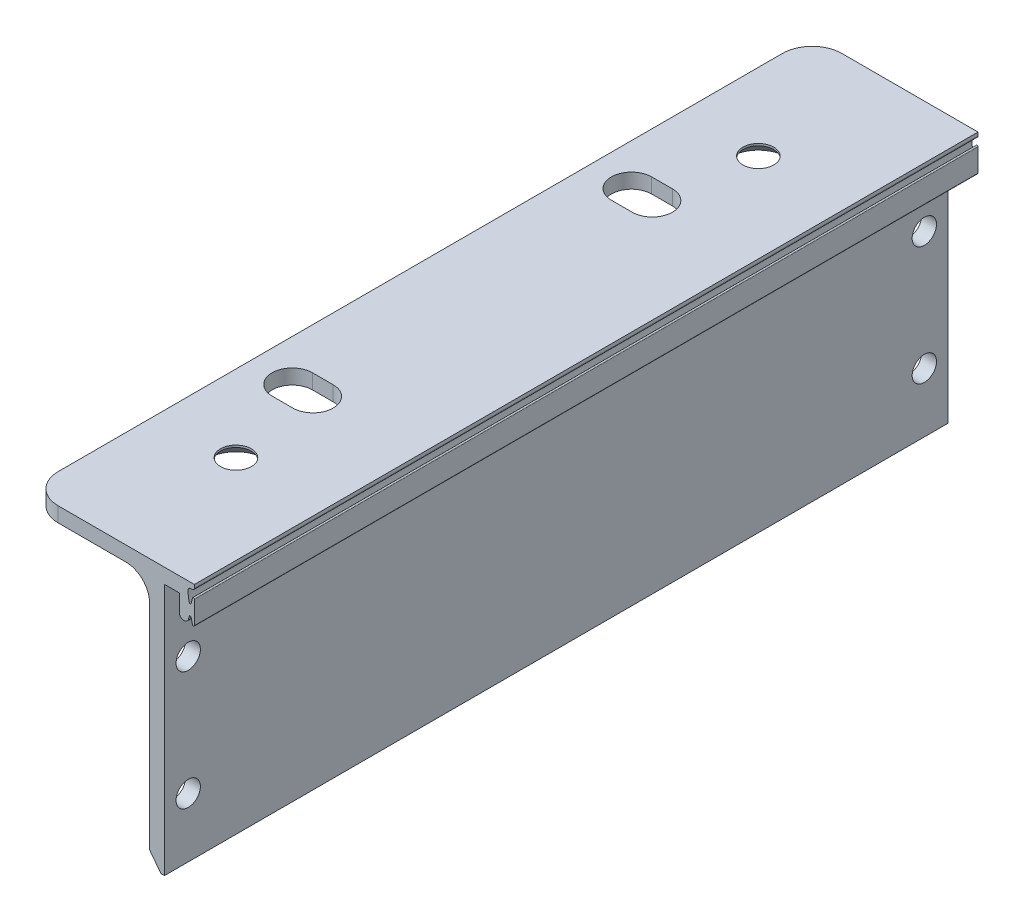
ISO-10303-21;
HEADER;
FILE_DESCRIPTION(('STEP AP214'),'2;1');
FILE_NAME('part.step','',(''),(''),'','','');
FILE_SCHEMA(('AUTOMOTIVE_DESIGN { 1 0 10303 214 1 1 1 1 }'));
ENDSEC;
DATA;
#1=APPLICATION_CONTEXT('core data for automotive mechanical design processes');
#2=APPLICATION_PROTOCOL_DEFINITION('international standard','automotive_design',2000,#1);
#3=PRODUCT_CONTEXT('',#1,'mechanical');
#4=PRODUCT('Part','Part','',(#3));
#5=PRODUCT_RELATED_PRODUCT_CATEGORY('part','',(#4));
#6=PRODUCT_DEFINITION_FORMATION('','',#4);
#7=PRODUCT_DEFINITION_CONTEXT('part definition',#1,'design');
#8=PRODUCT_DEFINITION('design','',#6,#7);
#9=PRODUCT_DEFINITION_SHAPE('','',#8);
#10=(LENGTH_UNIT() NAMED_UNIT(*) SI_UNIT(.MILLI.,.METRE.));
#11=(NAMED_UNIT(*) PLANE_ANGLE_UNIT() SI_UNIT($,.RADIAN.));
#12=(NAMED_UNIT(*) SI_UNIT($,.STERADIAN.) SOLID_ANGLE_UNIT());
#13=UNCERTAINTY_MEASURE_WITH_UNIT(LENGTH_MEASURE(1.E-05),#10,'distance_accuracy_value','');
#14=(GEOMETRIC_REPRESENTATION_CONTEXT(3) GLOBAL_UNCERTAINTY_ASSIGNED_CONTEXT((#13)) GLOBAL_UNIT_ASSIGNED_CONTEXT((#10,
#11,#12)) REPRESENTATION_CONTEXT('',''));
#15=CARTESIAN_POINT('',(0.,0.,0.));
#16=DIRECTION('',(0.,0.,1.));
#17=DIRECTION('',(1.,0.,0.));
#18=AXIS2_PLACEMENT_3D('',#15,#16,#17);
#19=CARTESIAN_POINT('',(2128.435090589,-3070.271459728,66.));
#20=DIRECTION('',(0.,0.,-1.));
#21=DIRECTION('',(-1.,0.,0.));
#22=AXIS2_PLACEMENT_3D('',#19,#20,#21);
#23=CYLINDRICAL_SURFACE('',#22,4.);
#24=DIRECTION('',(0.,0.,-1.));
#25=VECTOR('',#24,1.);
#26=CARTESIAN_POINT('',(2128.435090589,-3066.271459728,66.));
#27=LINE('',#26,#25);
#28=CARTESIAN_POINT('',(2128.435090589,-3066.271459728,40.7456337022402));
#29=VERTEX_POINT('',#28);
#30=CARTESIAN_POINT('',(2128.435090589,-3066.271459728,-40.7456337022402));
#31=VERTEX_POINT('',#30);
#32=EDGE_CURVE('E490',#29,#31,#27,.T.);
#33=ORIENTED_EDGE('',*,*,#32,.T.);
#34=CARTESIAN_POINT('',(2128.435090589,-3066.271459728,-47.25436629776));
#35=CARTESIAN_POINT('',(2128.50233235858,-3066.27146163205,-47.1444437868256));
#36=CARTESIAN_POINT('',(2128.56559289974,-3066.27314669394,-47.0305715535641));
#37=CARTESIAN_POINT('',(2128.6844600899,-3066.27879676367,-46.7951635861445));
#38=CARTESIAN_POINT('',(2128.74006757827,-3066.28276378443,-46.6736288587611));
#39=CARTESIAN_POINT('',(2128.84372476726,-3066.29204679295,-46.4229258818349));
#40=CARTESIAN_POINT('',(2128.89180194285,-3066.29737019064,-46.2936394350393));
#41=CARTESIAN_POINT('',(2128.98016790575,-3066.30852088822,-46.0277224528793));
#42=CARTESIAN_POINT('',(2129.02073377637,-3066.31439632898,-45.8898924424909));
#43=CARTESIAN_POINT('',(2129.09243327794,-3066.32567641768,-45.6117979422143));
#44=CARTESIAN_POINT('',(2129.12385037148,-3066.33110904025,-45.4708837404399));
#45=CARTESIAN_POINT('',(2129.17789207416,-3066.34093801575,-45.1855979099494));
#46=CARTESIAN_POINT('',(2129.2005368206,-3066.34533718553,-45.0411858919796));
#47=CARTESIAN_POINT('',(2129.23702489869,-3066.35262731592,-44.7487705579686));
#48=CARTESIAN_POINT('',(2129.25085748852,-3066.35551589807,-44.6009410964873));
#49=CARTESIAN_POINT('',(2129.26947087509,-3066.3594399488,-44.3008543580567));
#50=CARTESIAN_POINT('',(2129.27408373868,-3066.36043811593,-44.1507506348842));
#51=CARTESIAN_POINT('',(2129.27414587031,-3066.36045133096,-43.8524446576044));
#52=CARTESIAN_POINT('',(2129.26961922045,-3066.35947206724,-43.7038471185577));
#53=CARTESIAN_POINT('',(2129.25154325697,-3066.35565965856,-43.407909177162));
#54=CARTESIAN_POINT('',(2129.23797908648,-3066.3528235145,-43.2604560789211));
#55=CARTESIAN_POINT('',(2129.21081297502,-3066.34738776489,-43.0404438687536));
#56=CARTESIAN_POINT('',(2129.20059581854,-3066.3453757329,-42.9671892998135));
#57=CARTESIAN_POINT('',(2129.17783607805,-3066.34100633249,-42.8210079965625));
#58=CARTESIAN_POINT('',(2129.16528653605,-3066.3386484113,-42.748105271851));
#59=CARTESIAN_POINT('',(2129.12451472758,-3066.33122402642,-42.5321512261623));
#60=CARTESIAN_POINT('',(2129.0931030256,-3066.32578918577,-42.3911049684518));
#61=CARTESIAN_POINT('',(2129.02198815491,-3066.31458643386,-42.1146746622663));
#62=CARTESIAN_POINT('',(2128.98229036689,-3066.30881816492,-41.9792886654));
#63=CARTESIAN_POINT('',(2128.89457925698,-3066.29769288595,-41.7141299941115));
#64=CARTESIAN_POINT('',(2128.84661374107,-3066.29233847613,-41.5844753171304));
#65=CARTESIAN_POINT('',(2128.7419025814,-3066.28289658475,-41.3304132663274));
#66=CARTESIAN_POINT('',(2128.68554654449,-3066.27885784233,-41.2070677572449));
#67=CARTESIAN_POINT('',(2128.56584046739,-3066.2731491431,-40.9698400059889));
#68=CARTESIAN_POINT('',(2128.50230727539,-3066.27146114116,-40.8555147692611));
#69=CARTESIAN_POINT('',(2128.435090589,-3066.271459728,-40.7456337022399));
#70=B_SPLINE_CURVE_WITH_KNOTS('',3,(#34,#35,#36,#37,#38,#39,#40,#41,#42,#43,#44,#45,#46,#47,#48,
#49,#50,#51,#52,#53,#54,#55,#56,#57,#58,#59,#60,#61,#62,#63,#64,#65,#66,#67,#68,#69),
.UNSPECIFIED.,.F.,.F.,(4,2,2,2,2,2,2,2,2,2,2,2,2,2,2,2,2,4),(0.,0.000446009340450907,
0.000892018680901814,0.00133802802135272,0.00178403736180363,0.00223004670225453,
0.00267605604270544,0.00312206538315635,0.00356807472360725,0.00401408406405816,
0.00446009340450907,0.00468309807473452,0.00490610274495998,0.00535211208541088,
0.00579812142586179,0.0062441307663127,0.0066901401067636,0.00713614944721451),.UNSPECIFIED.);
#71=CARTESIAN_POINT('',(2128.435090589,-3066.271459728,-47.2543662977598));
#72=VERTEX_POINT('',#71);
#73=EDGE_CURVE('E502',#31,#72,#70,.F.);
#74=ORIENTED_EDGE('',*,*,#73,.T.);
#75=CARTESIAN_POINT('',(2128.435090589,-3066.271459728,-66.));
#76=VERTEX_POINT('',#75);
#77=EDGE_CURVE('E415',#72,#76,#27,.T.);
#78=ORIENTED_EDGE('',*,*,#77,.T.);
#79=CARTESIAN_POINT('',(2128.435090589,-3070.271459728,-66.));
#80=DIRECTION('',(0.,0.,1.));
#81=DIRECTION('',(1.,0.,0.));
#82=AXIS2_PLACEMENT_3D('',#79,#80,#81);
#83=CIRCLE('',#82,4.);
#84=CARTESIAN_POINT('',(2132.435090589,-3070.271459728,-66.));
#85=VERTEX_POINT('',#84);
#86=EDGE_CURVE('E416',#85,#76,#83,.T.);
#87=ORIENTED_EDGE('',*,*,#86,.F.);
#88=DIRECTION('',(0.,0.,-1.));
#89=VECTOR('',#88,1.);
#90=CARTESIAN_POINT('',(2132.435090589,-3070.271459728,66.));
#91=LINE('',#90,#89);
#92=CARTESIAN_POINT('',(2132.435090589,-3070.271459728,66.));
#93=VERTEX_POINT('',#92);
#94=EDGE_CURVE('E521',#93,#85,#91,.T.);
#95=ORIENTED_EDGE('',*,*,#94,.F.);
#96=CARTESIAN_POINT('',(2128.435090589,-3070.271459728,66.));
#97=DIRECTION('',(0.,0.,1.));
#98=DIRECTION('',(1.,0.,0.));
#99=AXIS2_PLACEMENT_3D('',#96,#97,#98);
#100=CIRCLE('',#99,4.);
#101=CARTESIAN_POINT('',(2128.435090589,-3066.271459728,66.));
#102=VERTEX_POINT('',#101);
#103=EDGE_CURVE('E358',#93,#102,#100,.T.);
#104=ORIENTED_EDGE('',*,*,#103,.T.);
#105=CARTESIAN_POINT('',(2128.435090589,-3066.271459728,47.2543662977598));
#106=VERTEX_POINT('',#105);
#107=EDGE_CURVE('E487',#102,#106,#27,.T.);
#108=ORIENTED_EDGE('',*,*,#107,.T.);
#109=CARTESIAN_POINT('',(2128.435090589,-3066.271459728,40.7456337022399));
#110=CARTESIAN_POINT('',(2128.50233235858,-3066.27146163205,40.8555562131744));
#111=CARTESIAN_POINT('',(2128.56559289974,-3066.27314669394,40.9694284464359));
#112=CARTESIAN_POINT('',(2128.6844600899,-3066.27879676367,41.2048364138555));
#113=CARTESIAN_POINT('',(2128.74006757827,-3066.28276378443,41.3263711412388));
#114=CARTESIAN_POINT('',(2128.84372476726,-3066.29204679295,41.5770741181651));
#115=CARTESIAN_POINT('',(2128.89180194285,-3066.29737019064,41.7063605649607));
#116=CARTESIAN_POINT('',(2128.98016790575,-3066.30852088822,41.9722775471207));
#117=CARTESIAN_POINT('',(2129.02073377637,-3066.31439632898,42.1101075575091));
#118=CARTESIAN_POINT('',(2129.09243327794,-3066.32567641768,42.3882020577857));
#119=CARTESIAN_POINT('',(2129.12385037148,-3066.33110904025,42.5291162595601));
#120=CARTESIAN_POINT('',(2129.17789207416,-3066.34093801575,42.8144020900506));
#121=CARTESIAN_POINT('',(2129.2005368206,-3066.34533718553,42.9588141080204));
#122=CARTESIAN_POINT('',(2129.23702489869,-3066.35262731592,43.2512294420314));
#123=CARTESIAN_POINT('',(2129.25085748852,-3066.35551589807,43.3990589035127));
#124=CARTESIAN_POINT('',(2129.26947087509,-3066.3594399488,43.6991456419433));
#125=CARTESIAN_POINT('',(2129.27408373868,-3066.36043811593,43.8492493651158));
#126=CARTESIAN_POINT('',(2129.27414587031,-3066.36045133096,44.1475553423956));
#127=CARTESIAN_POINT('',(2129.26961922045,-3066.35947206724,44.2961528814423));
#128=CARTESIAN_POINT('',(2129.25154325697,-3066.35565965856,44.5920908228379));
#129=CARTESIAN_POINT('',(2129.23797908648,-3066.3528235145,44.7395439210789));
#130=CARTESIAN_POINT('',(2129.21081297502,-3066.34738776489,44.9595561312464));
#131=CARTESIAN_POINT('',(2129.20059581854,-3066.3453757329,45.0328107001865));
#132=CARTESIAN_POINT('',(2129.17783607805,-3066.34100633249,45.1789920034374));
#133=CARTESIAN_POINT('',(2129.16528653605,-3066.3386484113,45.251894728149));
#134=CARTESIAN_POINT('',(2129.12451472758,-3066.33122402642,45.4678487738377));
#135=CARTESIAN_POINT('',(2129.0931030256,-3066.32578918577,45.6088950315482));
#136=CARTESIAN_POINT('',(2129.02198815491,-3066.31458643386,45.8853253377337));
#137=CARTESIAN_POINT('',(2128.98229036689,-3066.30881816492,46.0207113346));
#138=CARTESIAN_POINT('',(2128.89457925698,-3066.29769288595,46.2858700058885));
#139=CARTESIAN_POINT('',(2128.84661374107,-3066.29233847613,46.4155246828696));
#140=CARTESIAN_POINT('',(2128.7419025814,-3066.28289658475,46.6695867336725));
#141=CARTESIAN_POINT('',(2128.68554654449,-3066.27885784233,46.7929322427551));
#142=CARTESIAN_POINT('',(2128.56584046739,-3066.2731491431,47.030159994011));
#143=CARTESIAN_POINT('',(2128.50230727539,-3066.27146114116,47.1444852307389));
#144=CARTESIAN_POINT('',(2128.435090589,-3066.271459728,47.2543662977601));
#145=B_SPLINE_CURVE_WITH_KNOTS('',3,(#109,#110,#111,#112,#113,#114,#115,#116,#117,#118,#119,
#120,#121,#122,#123,#124,#125,#126,#127,#128,#129,#130,#131,#132,#133,#134,#135,#136,#137,#138,
#139,#140,#141,#142,#143,#144),.UNSPECIFIED.,.F.,.F.,(4,2,2,2,2,2,2,2,2,2,2,2,2,2,2,2,2,4),(0.,
0.000446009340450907,0.000892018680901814,0.00133802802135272,0.00178403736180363,
0.00223004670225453,0.00267605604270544,0.00312206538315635,0.00356807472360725,
0.00401408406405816,0.00446009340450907,0.00468309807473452,0.00490610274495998,
0.00535211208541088,0.00579812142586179,0.0062441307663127,0.0066901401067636,
0.00713614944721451),.UNSPECIFIED.);
#146=EDGE_CURVE('E579',#106,#29,#145,.F.);
#147=ORIENTED_EDGE('',*,*,#146,.T.);
#148=EDGE_LOOP('',(#33,#74,#78,#87,#95,#104,#108,#147));
#149=FACE_BOUND('',#148,.T.);
#150=ADVANCED_FACE('F38',(#149),#23,.F.);
#151=CARTESIAN_POINT('',(2132.43509058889,7.89159512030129E-11,66.));
#152=DIRECTION('',(1.,0.,0.));
#153=DIRECTION('',(0.,1.,0.));
#154=AXIS2_PLACEMENT_3D('',#151,#152,#153);
#155=PLANE('',#154);
#156=CARTESIAN_POINT('',(2132.435090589,-3078.771459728,62.));
#157=DIRECTION('',(-1.,0.,0.));
#158=DIRECTION('',(0.,1.,0.));
#159=AXIS2_PLACEMENT_3D('',#156,#157,#158);
#160=CIRCLE('',#159,2.0499999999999);
#161=CARTESIAN_POINT('',(2132.435090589,-3076.721459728,62.));
#162=VERTEX_POINT('',#161);
#163=EDGE_CURVE('E336',#162,#162,#160,.T.);
#164=ORIENTED_EDGE('',*,*,#163,.F.);
#165=EDGE_LOOP('',(#164));
#166=FACE_BOUND('',#165,.T.);
#167=CARTESIAN_POINT('',(2132.435090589,-3098.771459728,62.));
#168=DIRECTION('',(-1.,0.,0.));
#169=DIRECTION('',(0.,1.,0.));
#170=AXIS2_PLACEMENT_3D('',#167,#168,#169);
#171=CIRCLE('',#170,2.0499999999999);
#172=CARTESIAN_POINT('',(2132.435090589,-3096.721459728,62.));
#173=VERTEX_POINT('',#172);
#174=EDGE_CURVE('E346',#173,#173,#171,.T.);
#175=ORIENTED_EDGE('',*,*,#174,.F.);
#176=EDGE_LOOP('',(#175));
#177=FACE_BOUND('',#176,.T.);
#178=CARTESIAN_POINT('',(2132.435090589,-3098.771459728,-62.));
#179=DIRECTION('',(-1.,0.,0.));
#180=DIRECTION('',(0.,-1.,0.));
#181=AXIS2_PLACEMENT_3D('',#178,#179,#180);
#182=CIRCLE('',#181,2.0499999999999);
#183=CARTESIAN_POINT('',(2132.435090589,-3100.821459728,-62.));
#184=VERTEX_POINT('',#183);
#185=EDGE_CURVE('E350',#184,#184,#182,.T.);
#186=ORIENTED_EDGE('',*,*,#185,.F.);
#187=EDGE_LOOP('',(#186));
#188=FACE_BOUND('',#187,.T.);
#189=CARTESIAN_POINT('',(2132.435090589,-3078.771459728,-62.));
#190=DIRECTION('',(-1.,0.,0.));
#191=DIRECTION('',(0.,-1.,0.));
#192=AXIS2_PLACEMENT_3D('',#189,#190,#191);
#193=CIRCLE('',#192,2.0499999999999);
#194=CARTESIAN_POINT('',(2132.435090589,-3080.821459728,-62.));
#195=VERTEX_POINT('',#194);
#196=EDGE_CURVE('E354',#195,#195,#193,.T.);
#197=ORIENTED_EDGE('',*,*,#196,.F.);
#198=EDGE_LOOP('',(#197));
#199=FACE_BOUND('',#198,.T.);
#200=DIRECTION('',(0.,-1.,0.));
#201=VECTOR('',#200,1.);
#202=CARTESIAN_POINT('',(2132.43509058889,7.89159512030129E-11,-66.));
#203=LINE('',#202,#201);
#204=CARTESIAN_POINT('',(2132.435090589,-3106.271459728,-66.));
#205=VERTEX_POINT('',#204);
#206=EDGE_CURVE('E419',#85,#205,#203,.T.);
#207=ORIENTED_EDGE('',*,*,#206,.T.);
#208=DIRECTION('',(0.,0.,-1.));
#209=VECTOR('',#208,1.);
#210=CARTESIAN_POINT('',(2132.435090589,-3106.271459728,66.));
#211=LINE('',#210,#209);
#212=CARTESIAN_POINT('',(2132.435090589,-3106.271459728,66.));
#213=VERTEX_POINT('',#212);
#214=EDGE_CURVE('E519',#213,#205,#211,.T.);
#215=ORIENTED_EDGE('',*,*,#214,.F.);
#216=DIRECTION('',(0.,-1.,0.));
#217=VECTOR('',#216,1.);
#218=CARTESIAN_POINT('',(2132.43509058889,7.89159512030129E-11,66.));
#219=LINE('',#218,#217);
#220=EDGE_CURVE('E361',#93,#213,#219,.T.);
#221=ORIENTED_EDGE('',*,*,#220,.F.);
#222=ORIENTED_EDGE('',*,*,#94,.T.);
#223=EDGE_LOOP('',(#207,#215,#221,#222));
#224=FACE_BOUND('',#223,.T.);
#225=ADVANCED_FACE('F517',(#166,#177,#188,#199,#224),#155,.F.);
#226=CARTESIAN_POINT('',(-144.733277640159,-109.997291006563,66.));
#227=DIRECTION('',(0.796162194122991,0.605083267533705,0.));
#228=DIRECTION('',(-0.605083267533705,0.796162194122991,0.));
#229=AXIS2_PLACEMENT_3D('',#226,#227,#228);
#230=PLANE('',#229);
#231=DIRECTION('',(0.605083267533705,-0.796162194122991,0.));
#232=VECTOR('',#231,1.);
#233=CARTESIAN_POINT('',(-144.733277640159,-109.997291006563,-66.));
#234=LINE('',#233,#232);
#235=CARTESIAN_POINT('',(2134.335090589,-3108.771459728,-66.));
#236=VERTEX_POINT('',#235);
#237=EDGE_CURVE('E421',#205,#236,#234,.T.);
#238=ORIENTED_EDGE('',*,*,#237,.T.);
#239=DIRECTION('',(0.,0.,-1.));
#240=VECTOR('',#239,1.);
#241=CARTESIAN_POINT('',(2134.335090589,-3108.771459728,66.));
#242=LINE('',#241,#240);
#243=CARTESIAN_POINT('',(2134.335090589,-3108.771459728,66.));
#244=VERTEX_POINT('',#243);
#245=EDGE_CURVE('E525',#244,#236,#242,.T.);
#246=ORIENTED_EDGE('',*,*,#245,.F.);
#247=DIRECTION('',(0.605083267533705,-0.796162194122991,0.));
#248=VECTOR('',#247,1.);
#249=CARTESIAN_POINT('',(-144.733277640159,-109.997291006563,66.));
#250=LINE('',#249,#248);
#251=EDGE_CURVE('E364',#213,#244,#250,.T.);
#252=ORIENTED_EDGE('',*,*,#251,.F.);
#253=ORIENTED_EDGE('',*,*,#214,.T.);
#254=EDGE_LOOP('',(#238,#246,#252,#253));
#255=FACE_BOUND('',#254,.T.);
#256=ADVANCED_FACE('F523',(#255),#230,.F.);
#257=CARTESIAN_POINT('',(0.,-3108.771459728,66.));
#258=DIRECTION('',(0.,-1.,0.));
#259=DIRECTION('',(0.,0.,-1.));
#260=AXIS2_PLACEMENT_3D('',#257,#258,#259);
#261=PLANE('',#260);
#262=DIRECTION('',(-1.,0.,0.));
#263=VECTOR('',#262,1.);
#264=CARTESIAN_POINT('',(0.,-3108.771459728,-66.));
#265=LINE('',#264,#263);
#266=CARTESIAN_POINT('',(2134.93509058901,-3108.771459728,-66.));
#267=VERTEX_POINT('',#266);
#268=EDGE_CURVE('E424',#267,#236,#265,.T.);
#269=ORIENTED_EDGE('',*,*,#268,.F.);
#270=DIRECTION('',(0.,0.,-1.));
#271=VECTOR('',#270,1.);
#272=CARTESIAN_POINT('',(2134.93509058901,-3108.771459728,66.));
#273=LINE('',#272,#271);
#274=CARTESIAN_POINT('',(2134.93509058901,-3108.771459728,66.));
#275=VERTEX_POINT('',#274);
#276=EDGE_CURVE('E529',#275,#267,#273,.T.);
#277=ORIENTED_EDGE('',*,*,#276,.F.);
#278=DIRECTION('',(-1.,0.,0.));
#279=VECTOR('',#278,1.);
#280=CARTESIAN_POINT('',(0.,-3108.771459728,66.));
#281=LINE('',#280,#279);
#282=EDGE_CURVE('E366',#275,#244,#281,.T.);
#283=ORIENTED_EDGE('',*,*,#282,.T.);
#284=ORIENTED_EDGE('',*,*,#245,.T.);
#285=EDGE_LOOP('',(#269,#277,#283,#284));
#286=FACE_BOUND('',#285,.T.);
#287=ADVANCED_FACE('F750',(#286),#261,.T.);
#288=CARTESIAN_POINT('',(2134.93509058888,8.92330952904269E-11,66.));
#289=DIRECTION('',(1.,0.,0.));
#290=DIRECTION('',(0.,1.,0.));
#291=AXIS2_PLACEMENT_3D('',#288,#289,#290);
#292=PLANE('',#291);
#293=CARTESIAN_POINT('',(2134.935090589,-3078.771459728,62.));
#294=DIRECTION('',(1.,0.,0.));
#295=DIRECTION('',(0.,1.,0.));
#296=AXIS2_PLACEMENT_3D('',#293,#294,#295);
#297=CIRCLE('',#296,2.0499999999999);
#298=CARTESIAN_POINT('',(2134.935090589,-3076.721459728,62.));
#299=VERTEX_POINT('',#298);
#300=EDGE_CURVE('E345',#299,#299,#297,.T.);
#301=ORIENTED_EDGE('',*,*,#300,.F.);
#302=EDGE_LOOP('',(#301));
#303=FACE_BOUND('',#302,.T.);
#304=CARTESIAN_POINT('',(2134.935090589,-3098.771459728,62.));
#305=DIRECTION('',(1.,0.,0.));
#306=DIRECTION('',(0.,1.,0.));
#307=AXIS2_PLACEMENT_3D('',#304,#305,#306);
#308=CIRCLE('',#307,2.0499999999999);
#309=CARTESIAN_POINT('',(2134.935090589,-3096.721459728,62.));
#310=VERTEX_POINT('',#309);
#311=EDGE_CURVE('E349',#310,#310,#308,.T.);
#312=ORIENTED_EDGE('',*,*,#311,.F.);
#313=EDGE_LOOP('',(#312));
#314=FACE_BOUND('',#313,.T.);
#315=CARTESIAN_POINT('',(2134.935090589,-3098.771459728,-62.));
#316=DIRECTION('',(1.,0.,0.));
#317=DIRECTION('',(0.,1.,0.));
#318=AXIS2_PLACEMENT_3D('',#315,#316,#317);
#319=CIRCLE('',#318,2.0499999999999);
#320=CARTESIAN_POINT('',(2134.935090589,-3096.721459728,-62.));
#321=VERTEX_POINT('',#320);
#322=EDGE_CURVE('E353',#321,#321,#319,.T.);
#323=ORIENTED_EDGE('',*,*,#322,.F.);
#324=EDGE_LOOP('',(#323));
#325=FACE_BOUND('',#324,.T.);
#326=CARTESIAN_POINT('',(2134.935090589,-3078.771459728,-62.));
#327=DIRECTION('',(1.,0.,0.));
#328=DIRECTION('',(0.,1.,0.));
#329=AXIS2_PLACEMENT_3D('',#326,#327,#328);
#330=CIRCLE('',#329,2.0499999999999);
#331=CARTESIAN_POINT('',(2134.935090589,-3076.721459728,-62.));
#332=VERTEX_POINT('',#331);
#333=EDGE_CURVE('E357',#332,#332,#330,.T.);
#334=ORIENTED_EDGE('',*,*,#333,.F.);
#335=EDGE_LOOP('',(#334));
#336=FACE_BOUND('',#335,.T.);
#337=DIRECTION('',(0.,-1.,0.));
#338=VECTOR('',#337,1.);
#339=CARTESIAN_POINT('',(2134.93509058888,8.92330952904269E-11,-66.));
#340=LINE('',#339,#338);
#341=CARTESIAN_POINT('',(2134.935090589,-3066.271459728,-66.));
#342=VERTEX_POINT('',#341);
#343=EDGE_CURVE('E427',#342,#267,#340,.T.);
#344=ORIENTED_EDGE('',*,*,#343,.F.);
#345=DIRECTION('',(0.,0.,-1.));
#346=VECTOR('',#345,1.);
#347=CARTESIAN_POINT('',(2134.935090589,-3066.271459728,66.));
#348=LINE('',#347,#346);
#349=CARTESIAN_POINT('',(2134.935090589,-3066.271459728,66.));
#350=VERTEX_POINT('',#349);
#351=EDGE_CURVE('E948',#350,#342,#348,.T.);
#352=ORIENTED_EDGE('',*,*,#351,.F.);
#353=DIRECTION('',(0.,-1.,0.));
#354=VECTOR('',#353,1.);
#355=CARTESIAN_POINT('',(2134.93509058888,8.92330952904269E-11,66.));
#356=LINE('',#355,#354);
#357=EDGE_CURVE('E369',#350,#275,#356,.T.);
#358=ORIENTED_EDGE('',*,*,#357,.T.);
#359=ORIENTED_EDGE('',*,*,#276,.T.);
#360=EDGE_LOOP('',(#344,#352,#358,#359));
#361=FACE_BOUND('',#360,.T.);
#362=ADVANCED_FACE('F746',(#303,#314,#325,#336,#361),#292,.T.);
#363=CARTESIAN_POINT('',(-1.08935845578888E-09,-3066.27145972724,66.));
#364=DIRECTION('',(3.55271367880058E-13,1.,0.));
#365=DIRECTION('',(-1.,3.55271367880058E-13,0.));
#366=AXIS2_PLACEMENT_3D('',#363,#364,#365);
#367=PLANE('',#366);
#368=DIRECTION('',(1.,-3.55271367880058E-13,0.));
#369=VECTOR('',#368,1.);
#370=CARTESIAN_POINT('',(-1.08935845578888E-09,-3066.27145972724,-66.));
#371=LINE('',#370,#369);
#372=CARTESIAN_POINT('',(2137.435090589,-3066.271459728,-66.));
#373=VERTEX_POINT('',#372);
#374=EDGE_CURVE('E430',#342,#373,#371,.T.);
#375=ORIENTED_EDGE('',*,*,#374,.T.);
#376=DIRECTION('',(0.,0.,-1.));
#377=VECTOR('',#376,1.);
#378=CARTESIAN_POINT('',(2137.435090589,-3066.271459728,66.));
#379=LINE('',#378,#377);
#380=CARTESIAN_POINT('',(2137.435090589,-3066.271459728,66.));
#381=VERTEX_POINT('',#380);
#382=EDGE_CURVE('E945',#381,#373,#379,.T.);
#383=ORIENTED_EDGE('',*,*,#382,.F.);
#384=DIRECTION('',(1.,-3.55271367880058E-13,0.));
#385=VECTOR('',#384,1.);
#386=CARTESIAN_POINT('',(-1.08935845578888E-09,-3066.27145972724,66.));
#387=LINE('',#386,#385);
#388=EDGE_CURVE('E372',#350,#381,#387,.T.);
#389=ORIENTED_EDGE('',*,*,#388,.F.);
#390=ORIENTED_EDGE('',*,*,#351,.T.);
#391=EDGE_LOOP('',(#375,#383,#389,#390));
#392=FACE_BOUND('',#391,.T.);
#393=ADVANCED_FACE('F742',(#392),#367,.F.);
#394=CARTESIAN_POINT('',(2137.43509058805,6.62327875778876E-10,66.));
#395=DIRECTION('',(1.,3.09870404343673E-13,0.));
#396=DIRECTION('',(-3.09870404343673E-13,1.,0.));
#397=AXIS2_PLACEMENT_3D('',#394,#395,#396);
#398=PLANE('',#397);
#399=DIRECTION('',(3.09870404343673E-13,-1.,0.));
#400=VECTOR('',#399,1.);
#401=CARTESIAN_POINT('',(2137.43509058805,6.62327875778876E-10,-66.));
#402=LINE('',#401,#400);
#403=CARTESIAN_POINT('',(2137.435090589,-3069.1377496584,-66.));
#404=VERTEX_POINT('',#403);
#405=EDGE_CURVE('E432',#373,#404,#402,.T.);
#406=ORIENTED_EDGE('',*,*,#405,.T.);
#407=DIRECTION('',(0.,0.,-1.));
#408=VECTOR('',#407,1.);
#409=CARTESIAN_POINT('',(2137.435090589,-3069.1377496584,66.));
#410=LINE('',#409,#408);
#411=CARTESIAN_POINT('',(2137.435090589,-3069.1377496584,66.));
#412=VERTEX_POINT('',#411);
#413=EDGE_CURVE('E942',#412,#404,#410,.T.);
#414=ORIENTED_EDGE('',*,*,#413,.F.);
#415=DIRECTION('',(3.09870404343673E-13,-1.,0.));
#416=VECTOR('',#415,1.);
#417=CARTESIAN_POINT('',(2137.43509058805,6.62327875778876E-10,66.));
#418=LINE('',#417,#416);
#419=EDGE_CURVE('E374',#381,#412,#418,.T.);
#420=ORIENTED_EDGE('',*,*,#419,.F.);
#421=ORIENTED_EDGE('',*,*,#382,.T.);
#422=EDGE_LOOP('',(#406,#414,#420,#421));
#423=FACE_BOUND('',#422,.T.);
#424=ADVANCED_FACE('F738',(#423),#398,.F.);
#425=CARTESIAN_POINT('',(2138.2188006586,-3069.1377496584,66.));
#426=DIRECTION('',(0.,0.,-1.));
#427=DIRECTION('',(-1.,0.,0.));
#428=AXIS2_PLACEMENT_3D('',#425,#426,#427);
#429=CYLINDRICAL_SURFACE('',#428,0.783710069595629);
#430=CARTESIAN_POINT('',(2138.2188006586,-3069.1377496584,-66.));
#431=DIRECTION('',(0.,0.,1.));
#432=DIRECTION('',(1.,0.,0.));
#433=AXIS2_PLACEMENT_3D('',#430,#431,#432);
#434=CIRCLE('',#433,0.783710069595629);
#435=CARTESIAN_POINT('',(2138.97524023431,-3069.34269023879,-66.));
#436=VERTEX_POINT('',#435);
#437=EDGE_CURVE('E434',#404,#436,#434,.T.);
#438=ORIENTED_EDGE('',*,*,#437,.T.);
#439=DIRECTION('',(0.,0.,-1.));
#440=VECTOR('',#439,1.);
#441=CARTESIAN_POINT('',(2138.97524023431,-3069.34269023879,66.));
#442=LINE('',#441,#440);
#443=CARTESIAN_POINT('',(2138.97524023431,-3069.34269023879,66.));
#444=VERTEX_POINT('',#443);
#445=EDGE_CURVE('E939',#444,#436,#442,.T.);
#446=ORIENTED_EDGE('',*,*,#445,.F.);
#447=CARTESIAN_POINT('',(2138.2188006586,-3069.1377496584,66.));
#448=DIRECTION('',(0.,0.,1.));
#449=DIRECTION('',(1.,0.,0.));
#450=AXIS2_PLACEMENT_3D('',#447,#448,#449);
#451=CIRCLE('',#450,0.783710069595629);
#452=EDGE_CURVE('E376',#412,#444,#451,.T.);
#453=ORIENTED_EDGE('',*,*,#452,.F.);
#454=ORIENTED_EDGE('',*,*,#413,.T.);
#455=EDGE_LOOP('',(#438,#446,#453,#454));
#456=FACE_BOUND('',#455,.T.);
#457=ADVANCED_FACE('F734',(#456),#429,.T.);
#458=CARTESIAN_POINT('',(2767.41239594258,-749.769209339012,66.));
#459=DIRECTION('',(-0.965203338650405,0.261500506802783,0.));
#460=DIRECTION('',(-0.261500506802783,-0.965203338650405,0.));
#461=AXIS2_PLACEMENT_3D('',#458,#459,#460);
#462=PLANE('',#461);
#463=DIRECTION('',(0.261500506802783,0.965203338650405,0.));
#464=VECTOR('',#463,1.);
#465=CARTESIAN_POINT('',(2767.41239594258,-749.769209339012,-66.));
#466=LINE('',#465,#464);
#467=CARTESIAN_POINT('',(2139.12031008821,-3068.80723465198,-66.));
#468=VERTEX_POINT('',#467);
#469=EDGE_CURVE('E436',#436,#468,#466,.T.);
#470=ORIENTED_EDGE('',*,*,#469,.T.);
#471=DIRECTION('',(0.,0.,-1.));
#472=VECTOR('',#471,1.);
#473=CARTESIAN_POINT('',(2139.12031008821,-3068.80723465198,66.));
#474=LINE('',#473,#472);
#475=CARTESIAN_POINT('',(2139.12031008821,-3068.80723465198,66.));
#476=VERTEX_POINT('',#475);
#477=EDGE_CURVE('E937',#476,#468,#474,.T.);
#478=ORIENTED_EDGE('',*,*,#477,.F.);
#479=DIRECTION('',(0.261500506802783,0.965203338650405,0.));
#480=VECTOR('',#479,1.);
#481=CARTESIAN_POINT('',(2767.41239594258,-749.769209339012,66.));
#482=LINE('',#481,#480);
#483=EDGE_CURVE('E378',#444,#476,#482,.T.);
#484=ORIENTED_EDGE('',*,*,#483,.F.);
#485=ORIENTED_EDGE('',*,*,#445,.T.);
#486=EDGE_LOOP('',(#470,#478,#484,#485));
#487=FACE_BOUND('',#486,.T.);
#488=ADVANCED_FACE('F730',(#487),#462,.F.);
#489=CARTESIAN_POINT('',(2139.265090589,-3068.846459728,66.));
#490=DIRECTION('',(0.,0.,-1.));
#491=DIRECTION('',(-1.,0.,0.));
#492=AXIS2_PLACEMENT_3D('',#489,#490,#491);
#493=CYLINDRICAL_SURFACE('',#492,0.149999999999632);
#494=CARTESIAN_POINT('',(2139.265090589,-3068.846459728,-66.));
#495=DIRECTION('',(0.,0.,1.));
#496=DIRECTION('',(1.,0.,0.));
#497=AXIS2_PLACEMENT_3D('',#494,#495,#496);
#498=CIRCLE('',#497,0.149999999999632);
#499=CARTESIAN_POINT('',(2139.41070658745,-3068.81045999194,-66.));
#500=VERTEX_POINT('',#499);
#501=EDGE_CURVE('E439',#500,#468,#498,.T.);
#502=ORIENTED_EDGE('',*,*,#501,.F.);
#503=DIRECTION('',(0.,0.,-1.));
#504=VECTOR('',#503,1.);
#505=CARTESIAN_POINT('',(2139.41070658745,-3068.81045999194,66.));
#506=LINE('',#505,#504);
#507=CARTESIAN_POINT('',(2139.41070658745,-3068.81045999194,66.));
#508=VERTEX_POINT('',#507);
#509=EDGE_CURVE('E935',#508,#500,#506,.T.);
#510=ORIENTED_EDGE('',*,*,#509,.F.);
#511=CARTESIAN_POINT('',(2139.265090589,-3068.846459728,66.));
#512=DIRECTION('',(0.,0.,1.));
#513=DIRECTION('',(1.,0.,0.));
#514=AXIS2_PLACEMENT_3D('',#511,#512,#513);
#515=CIRCLE('',#514,0.149999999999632);
#516=EDGE_CURVE('E380',#508,#476,#515,.T.);
#517=ORIENTED_EDGE('',*,*,#516,.T.);
#518=ORIENTED_EDGE('',*,*,#477,.T.);
#519=EDGE_LOOP('',(#502,#510,#517,#518));
#520=FACE_BOUND('',#519,.T.);
#521=ADVANCED_FACE('F726',(#520),#493,.F.);
#522=CARTESIAN_POINT('',(1301.19906034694,321.687336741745,66.));
#523=DIRECTION('',(0.970773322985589,0.239998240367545,0.));
#524=DIRECTION('',(-0.239998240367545,0.970773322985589,0.));
#525=AXIS2_PLACEMENT_3D('',#522,#523,#524);
#526=PLANE('',#525);
#527=DIRECTION('',(0.239998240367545,-0.970773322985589,0.));
#528=VECTOR('',#527,1.);
#529=CARTESIAN_POINT('',(1301.19906034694,321.687336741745,-66.));
#530=LINE('',#529,#528);
#531=CARTESIAN_POINT('',(2139.65483992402,-3069.79795944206,-66.));
#532=VERTEX_POINT('',#531);
#533=EDGE_CURVE('E442',#500,#532,#530,.T.);
#534=ORIENTED_EDGE('',*,*,#533,.T.);
#535=DIRECTION('',(0.,0.,-1.));
#536=VECTOR('',#535,1.);
#537=CARTESIAN_POINT('',(2139.65483992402,-3069.79795944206,66.));
#538=LINE('',#537,#536);
#539=CARTESIAN_POINT('',(2139.65483992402,-3069.79795944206,66.));
#540=VERTEX_POINT('',#539);
#541=EDGE_CURVE('E932',#540,#532,#538,.T.);
#542=ORIENTED_EDGE('',*,*,#541,.F.);
#543=DIRECTION('',(0.239998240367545,-0.970773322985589,0.));
#544=VECTOR('',#543,1.);
#545=CARTESIAN_POINT('',(1301.19906034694,321.687336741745,66.));
#546=LINE('',#545,#544);
#547=EDGE_CURVE('E383',#508,#540,#546,.T.);
#548=ORIENTED_EDGE('',*,*,#547,.F.);
#549=ORIENTED_EDGE('',*,*,#509,.T.);
#550=EDGE_LOOP('',(#534,#542,#548,#549));
#551=FACE_BOUND('',#550,.T.);
#552=ADVANCED_FACE('F722',(#551),#526,.F.);
#553=CARTESIAN_POINT('',(2139.812590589,-3069.758959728,66.));
#554=DIRECTION('',(0.,0.,-1.));
#555=DIRECTION('',(-1.,0.,0.));
#556=AXIS2_PLACEMENT_3D('',#553,#554,#555);
#557=CYLINDRICAL_SURFACE('',#556,0.162500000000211);
#558=CARTESIAN_POINT('',(2139.812590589,-3069.758959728,-66.));
#559=DIRECTION('',(0.,0.,1.));
#560=DIRECTION('',(1.,0.,0.));
#561=AXIS2_PLACEMENT_3D('',#558,#559,#560);
#562=CIRCLE('',#561,0.162500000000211);
#563=CARTESIAN_POINT('',(2139.97509058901,-3069.758959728,-66.));
#564=VERTEX_POINT('',#563);
#565=EDGE_CURVE('E444',#532,#564,#562,.T.);
#566=ORIENTED_EDGE('',*,*,#565,.T.);
#567=DIRECTION('',(0.,0.,-1.));
#568=VECTOR('',#567,1.);
#569=CARTESIAN_POINT('',(2139.97509058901,-3069.758959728,66.));
#570=LINE('',#569,#568);
#571=CARTESIAN_POINT('',(2139.97509058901,-3069.758959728,66.));
#572=VERTEX_POINT('',#571);
#573=EDGE_CURVE('E930',#572,#564,#570,.T.);
#574=ORIENTED_EDGE('',*,*,#573,.F.);
#575=CARTESIAN_POINT('',(2139.812590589,-3069.758959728,66.));
#576=DIRECTION('',(0.,0.,1.));
#577=DIRECTION('',(1.,0.,0.));
#578=AXIS2_PLACEMENT_3D('',#575,#576,#577);
#579=CIRCLE('',#578,0.162500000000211);
#580=EDGE_CURVE('E385',#540,#572,#579,.T.);
#581=ORIENTED_EDGE('',*,*,#580,.F.);
#582=ORIENTED_EDGE('',*,*,#541,.T.);
#583=EDGE_LOOP('',(#566,#574,#581,#582));
#584=FACE_BOUND('',#583,.T.);
#585=ADVANCED_FACE('F718',(#584),#557,.T.);
#586=CARTESIAN_POINT('',(2139.97509058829,4.96909723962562E-10,66.));
#587=DIRECTION('',(1.,2.32203508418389E-13,0.));
#588=DIRECTION('',(-2.32203508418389E-13,1.,0.));
#589=AXIS2_PLACEMENT_3D('',#586,#587,#588);
#590=PLANE('',#589);
#591=DIRECTION('',(2.32203508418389E-13,-1.,0.));
#592=VECTOR('',#591,1.);
#593=CARTESIAN_POINT('',(2139.97509058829,4.96909723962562E-10,-66.));
#594=LINE('',#593,#592);
#595=CARTESIAN_POINT('',(2139.975090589,-3065.933959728,-66.));
#596=VERTEX_POINT('',#595);
#597=EDGE_CURVE('E447',#596,#564,#594,.T.);
#598=ORIENTED_EDGE('',*,*,#597,.F.);
#599=DIRECTION('',(0.,0.,-1.));
#600=VECTOR('',#599,1.);
#601=CARTESIAN_POINT('',(2139.975090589,-3065.933959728,66.));
#602=LINE('',#601,#600);
#603=CARTESIAN_POINT('',(2139.975090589,-3065.933959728,66.));
#604=VERTEX_POINT('',#603);
#605=EDGE_CURVE('E928',#604,#596,#602,.T.);
#606=ORIENTED_EDGE('',*,*,#605,.F.);
#607=DIRECTION('',(2.32203508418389E-13,-1.,0.));
#608=VECTOR('',#607,1.);
#609=CARTESIAN_POINT('',(2139.97509058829,4.96909723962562E-10,66.));
#610=LINE('',#609,#608);
#611=EDGE_CURVE('E387',#604,#572,#610,.T.);
#612=ORIENTED_EDGE('',*,*,#611,.T.);
#613=ORIENTED_EDGE('',*,*,#573,.T.);
#614=EDGE_LOOP('',(#598,#606,#612,#613));
#615=FACE_BOUND('',#614,.T.);
#616=ADVANCED_FACE('F714',(#615),#590,.T.);
#617=CARTESIAN_POINT('',(2139.812590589,-3065.933959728,66.));
#618=DIRECTION('',(0.,0.,-1.));
#619=DIRECTION('',(-1.,0.,0.));
#620=AXIS2_PLACEMENT_3D('',#617,#618,#619);
#621=CYLINDRICAL_SURFACE('',#620,0.162500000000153);
#622=CARTESIAN_POINT('',(2139.812590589,-3065.933959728,-66.));
#623=DIRECTION('',(0.,0.,1.));
#624=DIRECTION('',(1.,0.,0.));
#625=AXIS2_PLACEMENT_3D('',#622,#623,#624);
#626=CIRCLE('',#625,0.162500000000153);
#627=CARTESIAN_POINT('',(2139.65483992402,-3065.89496001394,-66.));
#628=VERTEX_POINT('',#627);
#629=EDGE_CURVE('E450',#596,#628,#626,.T.);
#630=ORIENTED_EDGE('',*,*,#629,.T.);
#631=DIRECTION('',(0.,0.,-1.));
#632=VECTOR('',#631,1.);
#633=CARTESIAN_POINT('',(2139.65483992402,-3065.89496001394,66.));
#634=LINE('',#633,#632);
#635=CARTESIAN_POINT('',(2139.65483992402,-3065.89496001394,66.));
#636=VERTEX_POINT('',#635);
#637=EDGE_CURVE('E926',#636,#628,#634,.T.);
#638=ORIENTED_EDGE('',*,*,#637,.F.);
#639=CARTESIAN_POINT('',(2139.812590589,-3065.933959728,66.));
#640=DIRECTION('',(0.,0.,1.));
#641=DIRECTION('',(1.,0.,0.));
#642=AXIS2_PLACEMENT_3D('',#639,#640,#641);
#643=CIRCLE('',#642,0.162500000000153);
#644=EDGE_CURVE('E390',#604,#636,#643,.T.);
#645=ORIENTED_EDGE('',*,*,#644,.F.);
#646=ORIENTED_EDGE('',*,*,#605,.T.);
#647=EDGE_LOOP('',(#630,#638,#645,#646));
#648=FACE_BOUND('',#647,.T.);
#649=ADVANCED_FACE('F710',(#648),#621,.T.);
#650=CARTESIAN_POINT('',(2730.71666034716,-675.098066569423,66.));
#651=DIRECTION('',(-0.970773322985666,0.23999824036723,0.));
#652=DIRECTION('',(-0.23999824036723,-0.970773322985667,0.));
#653=AXIS2_PLACEMENT_3D('',#650,#651,#652);
#654=PLANE('',#653);
#655=DIRECTION('',(0.23999824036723,0.970773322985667,0.));
#656=VECTOR('',#655,1.);
#657=CARTESIAN_POINT('',(2730.71666034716,-675.098066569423,-66.));
#658=LINE('',#657,#656);
#659=CARTESIAN_POINT('',(2139.41070658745,-3066.88245946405,-66.));
#660=VERTEX_POINT('',#659);
#661=EDGE_CURVE('E453',#660,#628,#658,.T.);
#662=ORIENTED_EDGE('',*,*,#661,.F.);
#663=DIRECTION('',(0.,0.,-1.));
#664=VECTOR('',#663,1.);
#665=CARTESIAN_POINT('',(2139.41070658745,-3066.88245946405,66.));
#666=LINE('',#665,#664);
#667=CARTESIAN_POINT('',(2139.41070658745,-3066.88245946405,66.));
#668=VERTEX_POINT('',#667);
#669=EDGE_CURVE('E924',#668,#660,#666,.T.);
#670=ORIENTED_EDGE('',*,*,#669,.F.);
#671=DIRECTION('',(0.23999824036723,0.970773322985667,0.));
#672=VECTOR('',#671,1.);
#673=CARTESIAN_POINT('',(2730.71666034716,-675.098066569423,66.));
#674=LINE('',#673,#672);
#675=EDGE_CURVE('E392',#668,#636,#674,.T.);
#676=ORIENTED_EDGE('',*,*,#675,.T.);
#677=ORIENTED_EDGE('',*,*,#637,.T.);
#678=EDGE_LOOP('',(#662,#670,#676,#677));
#679=FACE_BOUND('',#678,.T.);
#680=ADVANCED_FACE('F706',(#679),#654,.T.);
#681=CARTESIAN_POINT('',(2139.265090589,-3066.846459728,66.));
#682=DIRECTION('',(0.,0.,-1.));
#683=DIRECTION('',(-1.,0.,0.));
#684=AXIS2_PLACEMENT_3D('',#681,#682,#683);
#685=CYLINDRICAL_SURFACE('',#684,0.149999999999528);
#686=CARTESIAN_POINT('',(2139.265090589,-3066.846459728,-66.));
#687=DIRECTION('',(0.,0.,1.));
#688=DIRECTION('',(1.,0.,0.));
#689=AXIS2_PLACEMENT_3D('',#686,#687,#688);
#690=CIRCLE('',#689,0.149999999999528);
#691=CARTESIAN_POINT('',(2139.11611424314,-3066.86395396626,-66.));
#692=VERTEX_POINT('',#691);
#693=EDGE_CURVE('E456',#692,#660,#690,.T.);
#694=ORIENTED_EDGE('',*,*,#693,.F.);
#695=DIRECTION('',(0.,0.,-1.));
#696=VECTOR('',#695,1.);
#697=CARTESIAN_POINT('',(2139.11611424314,-3066.86395396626,66.));
#698=LINE('',#697,#696);
#699=CARTESIAN_POINT('',(2139.11611424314,-3066.86395396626,66.));
#700=VERTEX_POINT('',#699);
#701=EDGE_CURVE('E922',#700,#692,#698,.T.);
#702=ORIENTED_EDGE('',*,*,#701,.F.);
#703=CARTESIAN_POINT('',(2139.265090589,-3066.846459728,66.));
#704=DIRECTION('',(0.,0.,1.));
#705=DIRECTION('',(1.,0.,0.));
#706=AXIS2_PLACEMENT_3D('',#703,#704,#705);
#707=CIRCLE('',#706,0.149999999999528);
#708=EDGE_CURVE('E395',#700,#668,#707,.T.);
#709=ORIENTED_EDGE('',*,*,#708,.T.);
#710=ORIENTED_EDGE('',*,*,#669,.T.);
#711=EDGE_LOOP('',(#694,#702,#709,#710));
#712=FACE_BOUND('',#711,.T.);
#713=ADVANCED_FACE('F702',(#712),#685,.F.);
#714=CARTESIAN_POINT('',(2145.36317534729,-3065.27398447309,66.));
#715=DIRECTION('',(0.,0.,-1.));
#716=DIRECTION('',(-1.,0.,0.));
#717=AXIS2_PLACEMENT_3D('',#714,#715,#716);
#718=CYLINDRICAL_SURFACE('',#717,6.44622179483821);
#719=CARTESIAN_POINT('',(2145.36317534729,-3065.27398447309,-66.));
#720=DIRECTION('',(0.,0.,1.));
#721=DIRECTION('',(1.,0.,0.));
#722=AXIS2_PLACEMENT_3D('',#719,#720,#721);
#723=CIRCLE('',#722,6.44622179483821);
#724=CARTESIAN_POINT('',(2138.92214729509,-3065.01527023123,-66.));
#725=VERTEX_POINT('',#724);
#726=EDGE_CURVE('E459',#725,#692,#723,.T.);
#727=ORIENTED_EDGE('',*,*,#726,.F.);
#728=DIRECTION('',(0.,0.,-1.));
#729=VECTOR('',#728,1.);
#730=CARTESIAN_POINT('',(2138.92214729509,-3065.01527023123,66.));
#731=LINE('',#730,#729);
#732=CARTESIAN_POINT('',(2138.92214729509,-3065.01527023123,66.));
#733=VERTEX_POINT('',#732);
#734=EDGE_CURVE('E920',#733,#725,#731,.T.);
#735=ORIENTED_EDGE('',*,*,#734,.F.);
#736=CARTESIAN_POINT('',(2145.36317534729,-3065.27398447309,66.));
#737=DIRECTION('',(0.,0.,1.));
#738=DIRECTION('',(1.,0.,0.));
#739=AXIS2_PLACEMENT_3D('',#736,#737,#738);
#740=CIRCLE('',#739,6.44622179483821);
#741=EDGE_CURVE('E398',#733,#700,#740,.T.);
#742=ORIENTED_EDGE('',*,*,#741,.T.);
#743=ORIENTED_EDGE('',*,*,#701,.T.);
#744=EDGE_LOOP('',(#727,#735,#742,#743));
#745=FACE_BOUND('',#744,.T.);
#746=ADVANCED_FACE('F698',(#745),#718,.F.);
#747=CARTESIAN_POINT('',(2139.22190558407,-3065.02731050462,66.));
#748=DIRECTION('',(0.,0.,-1.));
#749=DIRECTION('',(-1.,0.,0.));
#750=AXIS2_PLACEMENT_3D('',#747,#748,#749);
#751=CYLINDRICAL_SURFACE('',#750,0.300000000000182);
#752=CARTESIAN_POINT('',(2139.22190558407,-3065.02731050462,-66.));
#753=DIRECTION('',(0.,0.,1.));
#754=DIRECTION('',(1.,0.,0.));
#755=AXIS2_PLACEMENT_3D('',#752,#753,#754);
#756=CIRCLE('',#755,0.300000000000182);
#757=CARTESIAN_POINT('',(2139.17395851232,-3064.73116682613,-66.));
#758=VERTEX_POINT('',#757);
#759=EDGE_CURVE('E462',#758,#725,#756,.T.);
#760=ORIENTED_EDGE('',*,*,#759,.F.);
#761=DIRECTION('',(0.,0.,-1.));
#762=VECTOR('',#761,1.);
#763=CARTESIAN_POINT('',(2139.17395851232,-3064.73116682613,66.));
#764=LINE('',#763,#762);
#765=CARTESIAN_POINT('',(2139.17395851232,-3064.73116682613,66.));
#766=VERTEX_POINT('',#765);
#767=EDGE_CURVE('E918',#766,#758,#764,.T.);
#768=ORIENTED_EDGE('',*,*,#767,.F.);
#769=CARTESIAN_POINT('',(2139.22190558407,-3065.02731050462,66.));
#770=DIRECTION('',(0.,0.,1.));
#771=DIRECTION('',(1.,0.,0.));
#772=AXIS2_PLACEMENT_3D('',#769,#770,#771);
#773=CIRCLE('',#772,0.300000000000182);
#774=EDGE_CURVE('E401',#766,#733,#773,.T.);
#775=ORIENTED_EDGE('',*,*,#774,.T.);
#776=ORIENTED_EDGE('',*,*,#734,.T.);
#777=EDGE_LOOP('',(#760,#768,#775,#776));
#778=FACE_BOUND('',#777,.T.);
#779=ADVANCED_FACE('F694',(#778),#751,.F.);
#780=CARTESIAN_POINT('',(538.162136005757,-3323.94260475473,66.));
#781=DIRECTION('',(-0.159823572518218,0.987145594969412,0.));
#782=DIRECTION('',(-0.987145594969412,-0.159823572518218,0.));
#783=AXIS2_PLACEMENT_3D('',#780,#781,#782);
#784=PLANE('',#783);
#785=DIRECTION('',(0.987145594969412,0.159823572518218,0.));
#786=VECTOR('',#785,1.);
#787=CARTESIAN_POINT('',(538.162136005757,-3323.94260475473,-66.));
#788=LINE('',#787,#786);
#789=CARTESIAN_POINT('',(2139.72303766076,-3064.64226829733,-66.));
#790=VERTEX_POINT('',#789);
#791=EDGE_CURVE('E465',#758,#790,#788,.T.);
#792=ORIENTED_EDGE('',*,*,#791,.T.);
#793=DIRECTION('',(0.,0.,-1.));
#794=VECTOR('',#793,1.);
#795=CARTESIAN_POINT('',(2139.72303766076,-3064.64226829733,66.));
#796=LINE('',#795,#794);
#797=CARTESIAN_POINT('',(2139.72303766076,-3064.64226829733,66.));
#798=VERTEX_POINT('',#797);
#799=EDGE_CURVE('E915',#798,#790,#796,.T.);
#800=ORIENTED_EDGE('',*,*,#799,.F.);
#801=DIRECTION('',(0.987145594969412,0.159823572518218,0.));
#802=VECTOR('',#801,1.);
#803=CARTESIAN_POINT('',(538.162136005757,-3323.94260475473,66.));
#804=LINE('',#803,#802);
#805=EDGE_CURVE('E404',#766,#798,#804,.T.);
#806=ORIENTED_EDGE('',*,*,#805,.F.);
#807=ORIENTED_EDGE('',*,*,#767,.T.);
#808=EDGE_LOOP('',(#792,#800,#806,#807));
#809=FACE_BOUND('',#808,.T.);
#810=ADVANCED_FACE('F690',(#809),#784,.F.);
#811=CARTESIAN_POINT('',(2139.675090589,-3064.34612461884,66.));
#812=DIRECTION('',(0.,0.,-1.));
#813=DIRECTION('',(-1.,0.,0.));
#814=AXIS2_PLACEMENT_3D('',#811,#812,#813);
#815=CYLINDRICAL_SURFACE('',#814,0.300000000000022);
#816=CARTESIAN_POINT('',(2139.675090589,-3064.34612461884,-66.));
#817=DIRECTION('',(0.,0.,1.));
#818=DIRECTION('',(1.,0.,0.));
#819=AXIS2_PLACEMENT_3D('',#816,#817,#818);
#820=CIRCLE('',#819,0.300000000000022);
#821=CARTESIAN_POINT('',(2139.975090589,-3064.34612461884,-66.));
#822=VERTEX_POINT('',#821);
#823=EDGE_CURVE('E467',#790,#822,#820,.T.);
#824=ORIENTED_EDGE('',*,*,#823,.T.);
#825=DIRECTION('',(0.,0.,-1.));
#826=VECTOR('',#825,1.);
#827=CARTESIAN_POINT('',(2139.975090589,-3064.34612461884,66.));
#828=LINE('',#827,#826);
#829=CARTESIAN_POINT('',(2139.975090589,-3064.34612461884,66.));
#830=VERTEX_POINT('',#829);
#831=EDGE_CURVE('E911',#830,#822,#828,.T.);
#832=ORIENTED_EDGE('',*,*,#831,.F.);
#833=CARTESIAN_POINT('',(2139.675090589,-3064.34612461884,66.));
#834=DIRECTION('',(0.,0.,1.));
#835=DIRECTION('',(1.,0.,0.));
#836=AXIS2_PLACEMENT_3D('',#833,#834,#835);
#837=CIRCLE('',#836,0.300000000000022);
#838=EDGE_CURVE('E406',#798,#830,#837,.T.);
#839=ORIENTED_EDGE('',*,*,#838,.F.);
#840=ORIENTED_EDGE('',*,*,#799,.T.);
#841=EDGE_LOOP('',(#824,#832,#839,#840));
#842=FACE_BOUND('',#841,.T.);
#843=ADVANCED_FACE('F686',(#842),#815,.T.);
#844=CARTESIAN_POINT('',(2139.97509059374,-3.30745748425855E-09,66.));
#845=DIRECTION('',(1.,-1.54555887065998E-12,0.));
#846=DIRECTION('',(1.54555887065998E-12,1.,0.));
#847=AXIS2_PLACEMENT_3D('',#844,#845,#846);
#848=PLANE('',#847);
#849=DIRECTION('',(-1.54555887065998E-12,-1.,0.));
#850=VECTOR('',#849,1.);
#851=CARTESIAN_POINT('',(2139.97509059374,-3.30745748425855E-09,-66.));
#852=LINE('',#851,#850);
#853=CARTESIAN_POINT('',(2139.975090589,-3063.771459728,-66.));
#854=VERTEX_POINT('',#853);
#855=EDGE_CURVE('E470',#854,#822,#852,.T.);
#856=ORIENTED_EDGE('',*,*,#855,.F.);
#857=DIRECTION('',(0.,0.,-1.));
#858=VECTOR('',#857,1.);
#859=CARTESIAN_POINT('',(2139.975090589,-3063.771459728,66.));
#860=LINE('',#859,#858);
#861=CARTESIAN_POINT('',(2139.975090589,-3063.771459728,66.));
#862=VERTEX_POINT('',#861);
#863=EDGE_CURVE('E905',#862,#854,#860,.T.);
#864=ORIENTED_EDGE('',*,*,#863,.F.);
#865=DIRECTION('',(-1.54555887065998E-12,-1.,0.));
#866=VECTOR('',#865,1.);
#867=CARTESIAN_POINT('',(2139.97509059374,-3.30745748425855E-09,66.));
#868=LINE('',#867,#866);
#869=EDGE_CURVE('E408',#862,#830,#868,.T.);
#870=ORIENTED_EDGE('',*,*,#869,.T.);
#871=ORIENTED_EDGE('',*,*,#831,.T.);
#872=EDGE_LOOP('',(#856,#864,#870,#871));
#873=FACE_BOUND('',#872,.T.);
#874=ADVANCED_FACE('F682',(#873),#848,.T.);
#875=CARTESIAN_POINT('',(-4.86967733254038E-11,-3063.77145972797,66.));
#876=DIRECTION('',(0.,1.,0.));
#877=DIRECTION('',(-1.,0.,0.));
#878=AXIS2_PLACEMENT_3D('',#875,#876,#877);
#879=PLANE('',#878);
#880=CARTESIAN_POINT('',(2124.975090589,-3063.771459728,44.));
#881=DIRECTION('',(0.,1.,0.));
#882=DIRECTION('',(0.,0.,1.));
#883=AXIS2_PLACEMENT_3D('',#880,#881,#882);
#884=CIRCLE('',#883,2.60000000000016);
#885=CARTESIAN_POINT('',(2124.975090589,-3063.771459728,46.6000000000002));
#886=VERTEX_POINT('',#885);
#887=EDGE_CURVE('E885',#886,#886,#884,.T.);
#888=ORIENTED_EDGE('',*,*,#887,.F.);
#889=EDGE_LOOP('',(#888));
#890=FACE_BOUND('',#889,.T.);
#891=CARTESIAN_POINT('',(2124.975090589,-3063.771459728,-44.));
#892=DIRECTION('',(0.,1.,0.));
#893=DIRECTION('',(0.,0.,1.));
#894=AXIS2_PLACEMENT_3D('',#891,#892,#893);
#895=CIRCLE('',#894,2.60000000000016);
#896=CARTESIAN_POINT('',(2124.975090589,-3063.771459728,-41.3999999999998));
#897=VERTEX_POINT('',#896);
#898=EDGE_CURVE('E887',#897,#897,#895,.T.);
#899=ORIENTED_EDGE('',*,*,#898,.F.);
#900=EDGE_LOOP('',(#899));
#901=FACE_BOUND('',#900,.T.);
#902=CARTESIAN_POINT('',(2119.035090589,-3063.771459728,28.575));
#903=DIRECTION('',(0.,1.,0.));
#904=DIRECTION('',(1.,0.,0.));
#905=AXIS2_PLACEMENT_3D('',#902,#903,#904);
#906=CIRCLE('',#905,3.40000000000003);
#907=CARTESIAN_POINT('',(2119.035090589,-3063.771459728,25.1749999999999));
#908=VERTEX_POINT('',#907);
#909=CARTESIAN_POINT('',(2119.035090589,-3063.771459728,31.975));
#910=VERTEX_POINT('',#909);
#911=EDGE_CURVE('E308',#908,#910,#906,.T.);
#912=ORIENTED_EDGE('',*,*,#911,.F.);
#913=DIRECTION('',(-1.,0.,0.));
#914=VECTOR('',#913,1.);
#915=CARTESIAN_POINT('',(2119.035090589,-3063.771459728,25.1749999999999));
#916=LINE('',#915,#914);
#917=CARTESIAN_POINT('',(2122.535090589,-3063.771459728,25.175));
#918=VERTEX_POINT('',#917);
#919=EDGE_CURVE('E313',#918,#908,#916,.T.);
#920=ORIENTED_EDGE('',*,*,#919,.F.);
#921=CARTESIAN_POINT('',(2122.535090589,-3063.771459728,28.575));
#922=DIRECTION('',(0.,1.,0.));
#923=DIRECTION('',(1.,0.,0.));
#924=AXIS2_PLACEMENT_3D('',#921,#922,#923);
#925=CIRCLE('',#924,3.40000000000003);
#926=CARTESIAN_POINT('',(2122.535090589,-3063.771459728,31.975));
#927=VERTEX_POINT('',#926);
#928=EDGE_CURVE('E292',#927,#918,#925,.T.);
#929=ORIENTED_EDGE('',*,*,#928,.F.);
#930=DIRECTION('',(1.,0.,0.));
#931=VECTOR('',#930,1.);
#932=CARTESIAN_POINT('',(2119.035090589,-3063.771459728,31.975));
#933=LINE('',#932,#931);
#934=EDGE_CURVE('E303',#910,#927,#933,.T.);
#935=ORIENTED_EDGE('',*,*,#934,.F.);
#936=EDGE_LOOP('',(#912,#920,#929,#935));
#937=FACE_BOUND('',#936,.T.);
#938=CARTESIAN_POINT('',(2119.035090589,-3063.771459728,-28.575));
#939=DIRECTION('',(0.,1.,0.));
#940=DIRECTION('',(-1.,0.,0.));
#941=AXIS2_PLACEMENT_3D('',#938,#939,#940);
#942=CIRCLE('',#941,3.40000000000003);
#943=CARTESIAN_POINT('',(2119.035090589,-3063.771459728,-31.975));
#944=VERTEX_POINT('',#943);
#945=CARTESIAN_POINT('',(2119.035090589,-3063.771459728,-25.1749999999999));
#946=VERTEX_POINT('',#945);
#947=EDGE_CURVE('E320',#944,#946,#942,.T.);
#948=ORIENTED_EDGE('',*,*,#947,.F.);
#949=DIRECTION('',(-1.,0.,0.));
#950=VECTOR('',#949,1.);
#951=CARTESIAN_POINT('',(2119.035090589,-3063.771459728,-31.975));
#952=LINE('',#951,#950);
#953=CARTESIAN_POINT('',(2122.535090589,-3063.771459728,-31.975));
#954=VERTEX_POINT('',#953);
#955=EDGE_CURVE('E330',#954,#944,#952,.T.);
#956=ORIENTED_EDGE('',*,*,#955,.F.);
#957=CARTESIAN_POINT('',(2122.535090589,-3063.771459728,-28.575));
#958=DIRECTION('',(0.,1.,0.));
#959=DIRECTION('',(-1.,0.,0.));
#960=AXIS2_PLACEMENT_3D('',#957,#958,#959);
#961=CIRCLE('',#960,3.40000000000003);
#962=CARTESIAN_POINT('',(2122.535090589,-3063.771459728,-25.1749999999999));
#963=VERTEX_POINT('',#962);
#964=EDGE_CURVE('E327',#963,#954,#961,.T.);
#965=ORIENTED_EDGE('',*,*,#964,.F.);
#966=DIRECTION('',(1.,0.,0.));
#967=VECTOR('',#966,1.);
#968=CARTESIAN_POINT('',(2119.035090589,-3063.771459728,-25.1749999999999));
#969=LINE('',#968,#967);
#970=EDGE_CURVE('E324',#946,#963,#969,.T.);
#971=ORIENTED_EDGE('',*,*,#970,.F.);
#972=EDGE_LOOP('',(#948,#956,#965,#971));
#973=FACE_BOUND('',#972,.T.);
#974=DIRECTION('',(1.,0.,0.));
#975=VECTOR('',#974,1.);
#976=CARTESIAN_POINT('',(-4.86967733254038E-11,-3063.77145972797,-66.));
#977=LINE('',#976,#975);
#978=CARTESIAN_POINT('',(2117.035090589,-3063.771459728,-66.));
#979=VERTEX_POINT('',#978);
#980=EDGE_CURVE('E473',#979,#854,#977,.T.);
#981=ORIENTED_EDGE('',*,*,#980,.F.);
#982=CARTESIAN_POINT('',(2117.035090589,-3063.771459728,-61.));
#983=DIRECTION('',(0.,1.,0.));
#984=DIRECTION('',(-1.,0.,0.));
#985=AXIS2_PLACEMENT_3D('',#982,#983,#984);
#986=CIRCLE('',#985,5.);
#987=CARTESIAN_POINT('',(2112.035090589,-3063.771459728,-61.));
#988=VERTEX_POINT('',#987);
#989=EDGE_CURVE('E572',#979,#988,#986,.T.);
#990=ORIENTED_EDGE('',*,*,#989,.T.);
#991=DIRECTION('',(0.,0.,-1.));
#992=VECTOR('',#991,1.);
#993=CARTESIAN_POINT('',(2112.035090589,-3063.771459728,66.));
#994=LINE('',#993,#992);
#995=CARTESIAN_POINT('',(2112.035090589,-3063.771459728,61.));
#996=VERTEX_POINT('',#995);
#997=EDGE_CURVE('E910',#996,#988,#994,.T.);
#998=ORIENTED_EDGE('',*,*,#997,.F.);
#999=CARTESIAN_POINT('',(2117.035090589,-3063.771459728,61.));
#1000=DIRECTION('',(0.,1.,0.));
#1001=DIRECTION('',(-1.,0.,0.));
#1002=AXIS2_PLACEMENT_3D('',#999,#1000,#1001);
#1003=CIRCLE('',#1002,5.);
#1004=CARTESIAN_POINT('',(2117.035090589,-3063.771459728,66.));
#1005=VERTEX_POINT('',#1004);
#1006=EDGE_CURVE('E571',#996,#1005,#1003,.T.);
#1007=ORIENTED_EDGE('',*,*,#1006,.T.);
#1008=DIRECTION('',(1.,0.,0.));
#1009=VECTOR('',#1008,1.);
#1010=CARTESIAN_POINT('',(-4.86967733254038E-11,-3063.77145972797,66.));
#1011=LINE('',#1010,#1009);
#1012=EDGE_CURVE('E411',#1005,#862,#1011,.T.);
#1013=ORIENTED_EDGE('',*,*,#1012,.T.);
#1014=ORIENTED_EDGE('',*,*,#863,.T.);
#1015=EDGE_LOOP('',(#981,#990,#998,#1007,#1013,#1014));
#1016=FACE_BOUND('',#1015,.T.);
#1017=ADVANCED_FACE('F310',(#890,#901,#937,#973,#1016),#879,.T.);
#1018=CARTESIAN_POINT('',(2112.035090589,0.,66.));
#1019=DIRECTION('',(1.,0.,0.));
#1020=DIRECTION('',(0.,0.,-1.));
#1021=AXIS2_PLACEMENT_3D('',#1018,#1019,#1020);
#1022=PLANE('',#1021);
#1023=ORIENTED_EDGE('',*,*,#997,.T.);
#1024=DIRECTION('',(0.,-1.,0.));
#1025=VECTOR('',#1024,1.);
#1026=CARTESIAN_POINT('',(2112.035090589,0.,-61.));
#1027=LINE('',#1026,#1025);
#1028=CARTESIAN_POINT('',(2112.035090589,-3066.271459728,-61.));
#1029=VERTEX_POINT('',#1028);
#1030=EDGE_CURVE('E563',#988,#1029,#1027,.T.);
#1031=ORIENTED_EDGE('',*,*,#1030,.T.);
#1032=DIRECTION('',(0.,0.,-1.));
#1033=VECTOR('',#1032,1.);
#1034=CARTESIAN_POINT('',(2112.035090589,-3066.271459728,66.));
#1035=LINE('',#1034,#1033);
#1036=CARTESIAN_POINT('',(2112.035090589,-3066.271459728,61.));
#1037=VERTEX_POINT('',#1036);
#1038=EDGE_CURVE('E479',#1037,#1029,#1035,.T.);
#1039=ORIENTED_EDGE('',*,*,#1038,.F.);
#1040=DIRECTION('',(0.,-1.,0.));
#1041=VECTOR('',#1040,1.);
#1042=CARTESIAN_POINT('',(2112.035090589,-3063.771459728,61.));
#1043=LINE('',#1042,#1041);
#1044=EDGE_CURVE('E561',#1037,#996,#1043,.F.);
#1045=ORIENTED_EDGE('',*,*,#1044,.T.);
#1046=EDGE_LOOP('',(#1023,#1031,#1039,#1045));
#1047=FACE_BOUND('',#1046,.T.);
#1048=ADVANCED_FACE('F675',(#1047),#1022,.F.);
#1049=CARTESIAN_POINT('',(-8.30303701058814E-11,-3066.27145972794,66.));
#1050=DIRECTION('',(0.,1.,0.));
#1051=DIRECTION('',(-1.,0.,0.));
#1052=AXIS2_PLACEMENT_3D('',#1049,#1050,#1051);
#1053=PLANE('',#1052);
#1054=DIRECTION('',(-1.,0.,0.));
#1055=VECTOR('',#1054,1.);
#1056=CARTESIAN_POINT('',(-8.30303701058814E-11,-3066.27145972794,25.1749999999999));
#1057=LINE('',#1056,#1055);
#1058=CARTESIAN_POINT('',(2122.535090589,-3066.271459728,25.175));
#1059=VERTEX_POINT('',#1058);
#1060=CARTESIAN_POINT('',(2119.035090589,-3066.271459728,25.1749999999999));
#1061=VERTEX_POINT('',#1060);
#1062=EDGE_CURVE('E555',#1059,#1061,#1057,.T.);
#1063=ORIENTED_EDGE('',*,*,#1062,.T.);
#1064=CARTESIAN_POINT('',(2119.035090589,-3066.271459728,28.575));
#1065=DIRECTION('',(0.,1.,0.));
#1066=DIRECTION('',(-1.,0.,0.));
#1067=AXIS2_PLACEMENT_3D('',#1064,#1065,#1066);
#1068=CIRCLE('',#1067,3.40000000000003);
#1069=CARTESIAN_POINT('',(2119.035090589,-3066.271459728,31.975));
#1070=VERTEX_POINT('',#1069);
#1071=EDGE_CURVE('E558',#1061,#1070,#1068,.T.);
#1072=ORIENTED_EDGE('',*,*,#1071,.T.);
#1073=DIRECTION('',(1.,0.,0.));
#1074=VECTOR('',#1073,1.);
#1075=CARTESIAN_POINT('',(-8.30303701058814E-11,-3066.27145972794,31.975));
#1076=LINE('',#1075,#1074);
#1077=CARTESIAN_POINT('',(2122.535090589,-3066.271459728,31.975));
#1078=VERTEX_POINT('',#1077);
#1079=EDGE_CURVE('E552',#1070,#1078,#1076,.T.);
#1080=ORIENTED_EDGE('',*,*,#1079,.T.);
#1081=CARTESIAN_POINT('',(2122.535090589,-3066.271459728,28.575));
#1082=DIRECTION('',(0.,1.,0.));
#1083=DIRECTION('',(-1.,0.,0.));
#1084=AXIS2_PLACEMENT_3D('',#1081,#1082,#1083);
#1085=CIRCLE('',#1084,3.40000000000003);
#1086=EDGE_CURVE('E295',#1078,#1059,#1085,.T.);
#1087=ORIENTED_EDGE('',*,*,#1086,.T.);
#1088=EDGE_LOOP('',(#1063,#1072,#1080,#1087));
#1089=FACE_BOUND('',#1088,.T.);
#1090=DIRECTION('',(-1.,0.,0.));
#1091=VECTOR('',#1090,1.);
#1092=CARTESIAN_POINT('',(-8.30303701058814E-11,-3066.27145972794,-31.975));
#1093=LINE('',#1092,#1091);
#1094=CARTESIAN_POINT('',(2122.535090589,-3066.271459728,-31.975));
#1095=VERTEX_POINT('',#1094);
#1096=CARTESIAN_POINT('',(2119.035090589,-3066.271459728,-31.975));
#1097=VERTEX_POINT('',#1096);
#1098=EDGE_CURVE('E546',#1095,#1097,#1093,.T.);
#1099=ORIENTED_EDGE('',*,*,#1098,.T.);
#1100=CARTESIAN_POINT('',(2119.035090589,-3066.271459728,-28.575));
#1101=DIRECTION('',(0.,1.,0.));
#1102=DIRECTION('',(-1.,0.,0.));
#1103=AXIS2_PLACEMENT_3D('',#1100,#1101,#1102);
#1104=CIRCLE('',#1103,3.40000000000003);
#1105=CARTESIAN_POINT('',(2119.035090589,-3066.271459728,-25.1749999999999));
#1106=VERTEX_POINT('',#1105);
#1107=EDGE_CURVE('E549',#1097,#1106,#1104,.T.);
#1108=ORIENTED_EDGE('',*,*,#1107,.T.);
#1109=DIRECTION('',(1.,0.,0.));
#1110=VECTOR('',#1109,1.);
#1111=CARTESIAN_POINT('',(-8.30303701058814E-11,-3066.27145972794,-25.1749999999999));
#1112=LINE('',#1111,#1110);
#1113=CARTESIAN_POINT('',(2122.535090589,-3066.271459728,-25.1749999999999));
#1114=VERTEX_POINT('',#1113);
#1115=EDGE_CURVE('E527',#1106,#1114,#1112,.T.);
#1116=ORIENTED_EDGE('',*,*,#1115,.T.);
#1117=CARTESIAN_POINT('',(2122.535090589,-3066.271459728,-28.575));
#1118=DIRECTION('',(0.,1.,0.));
#1119=DIRECTION('',(-1.,0.,0.));
#1120=AXIS2_PLACEMENT_3D('',#1117,#1118,#1119);
#1121=CIRCLE('',#1120,3.40000000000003);
#1122=EDGE_CURVE('E543',#1114,#1095,#1121,.T.);
#1123=ORIENTED_EDGE('',*,*,#1122,.T.);
#1124=EDGE_LOOP('',(#1099,#1108,#1116,#1123));
#1125=FACE_BOUND('',#1124,.T.);
#1126=ORIENTED_EDGE('',*,*,#77,.F.);
#1127=CARTESIAN_POINT('',(2124.975090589,-3066.271459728,-44.));
#1128=DIRECTION('',(0.,1.,0.));
#1129=DIRECTION('',(-1.,0.,0.));
#1130=AXIS2_PLACEMENT_3D('',#1127,#1128,#1129);
#1131=CIRCLE('',#1130,4.74999999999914);
#1132=EDGE_CURVE('E585',#72,#31,#1131,.T.);
#1133=ORIENTED_EDGE('',*,*,#1132,.T.);
#1134=ORIENTED_EDGE('',*,*,#32,.F.);
#1135=CARTESIAN_POINT('',(2124.975090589,-3066.271459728,44.));
#1136=DIRECTION('',(0.,1.,0.));
#1137=DIRECTION('',(-1.,0.,0.));
#1138=AXIS2_PLACEMENT_3D('',#1135,#1136,#1137);
#1139=CIRCLE('',#1138,4.74999999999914);
#1140=EDGE_CURVE('E584',#29,#106,#1139,.T.);
#1141=ORIENTED_EDGE('',*,*,#1140,.T.);
#1142=ORIENTED_EDGE('',*,*,#107,.F.);
#1143=DIRECTION('',(1.,0.,0.));
#1144=VECTOR('',#1143,1.);
#1145=CARTESIAN_POINT('',(-8.30303701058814E-11,-3066.27145972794,66.));
#1146=LINE('',#1145,#1144);
#1147=CARTESIAN_POINT('',(2117.035090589,-3066.271459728,66.));
#1148=VERTEX_POINT('',#1147);
#1149=EDGE_CURVE('E413',#1148,#102,#1146,.T.);
#1150=ORIENTED_EDGE('',*,*,#1149,.F.);
#1151=CARTESIAN_POINT('',(2117.035090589,-3066.271459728,61.));
#1152=DIRECTION('',(0.,1.,0.));
#1153=DIRECTION('',(-1.,0.,0.));
#1154=AXIS2_PLACEMENT_3D('',#1151,#1152,#1153);
#1155=CIRCLE('',#1154,5.);
#1156=EDGE_CURVE('E566',#1148,#1037,#1155,.F.);
#1157=ORIENTED_EDGE('',*,*,#1156,.T.);
#1158=ORIENTED_EDGE('',*,*,#1038,.T.);
#1159=CARTESIAN_POINT('',(2117.035090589,-3066.271459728,-61.));
#1160=DIRECTION('',(0.,1.,0.));
#1161=DIRECTION('',(-1.,0.,0.));
#1162=AXIS2_PLACEMENT_3D('',#1159,#1160,#1161);
#1163=CIRCLE('',#1162,5.);
#1164=CARTESIAN_POINT('',(2117.035090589,-3066.271459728,-66.));
#1165=VERTEX_POINT('',#1164);
#1166=EDGE_CURVE('E508',#1029,#1165,#1163,.F.);
#1167=ORIENTED_EDGE('',*,*,#1166,.T.);
#1168=DIRECTION('',(1.,0.,0.));
#1169=VECTOR('',#1168,1.);
#1170=CARTESIAN_POINT('',(-8.30303701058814E-11,-3066.27145972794,-66.));
#1171=LINE('',#1170,#1169);
#1172=EDGE_CURVE('E362',#1165,#76,#1171,.T.);
#1173=ORIENTED_EDGE('',*,*,#1172,.T.);
#1174=EDGE_LOOP('',(#1126,#1133,#1134,#1141,#1142,#1150,#1157,#1158,#1167,#1173));
#1175=FACE_BOUND('',#1174,.T.);
#1176=ADVANCED_FACE('F506',(#1089,#1125,#1175),#1053,.F.);
#1177=CARTESIAN_POINT('',(0.,0.,66.));
#1178=DIRECTION('',(0.,0.,1.));
#1179=DIRECTION('',(1.,0.,0.));
#1180=AXIS2_PLACEMENT_3D('',#1177,#1178,#1179);
#1181=PLANE('',#1180);
#1182=ORIENTED_EDGE('',*,*,#1012,.F.);
#1183=DIRECTION('',(0.,-1.,0.));
#1184=VECTOR('',#1183,1.);
#1185=CARTESIAN_POINT('',(2117.035090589,-3066.271459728,66.));
#1186=LINE('',#1185,#1184);
#1187=EDGE_CURVE('E491',#1005,#1148,#1186,.T.);
#1188=ORIENTED_EDGE('',*,*,#1187,.T.);
#1189=ORIENTED_EDGE('',*,*,#1149,.T.);
#1190=ORIENTED_EDGE('',*,*,#103,.F.);
#1191=ORIENTED_EDGE('',*,*,#220,.T.);
#1192=ORIENTED_EDGE('',*,*,#251,.T.);
#1193=ORIENTED_EDGE('',*,*,#282,.F.);
#1194=ORIENTED_EDGE('',*,*,#357,.F.);
#1195=ORIENTED_EDGE('',*,*,#388,.T.);
#1196=ORIENTED_EDGE('',*,*,#419,.T.);
#1197=ORIENTED_EDGE('',*,*,#452,.T.);
#1198=ORIENTED_EDGE('',*,*,#483,.T.);
#1199=ORIENTED_EDGE('',*,*,#516,.F.);
#1200=ORIENTED_EDGE('',*,*,#547,.T.);
#1201=ORIENTED_EDGE('',*,*,#580,.T.);
#1202=ORIENTED_EDGE('',*,*,#611,.F.);
#1203=ORIENTED_EDGE('',*,*,#644,.T.);
#1204=ORIENTED_EDGE('',*,*,#675,.F.);
#1205=ORIENTED_EDGE('',*,*,#708,.F.);
#1206=ORIENTED_EDGE('',*,*,#741,.F.);
#1207=ORIENTED_EDGE('',*,*,#774,.F.);
#1208=ORIENTED_EDGE('',*,*,#805,.T.);
#1209=ORIENTED_EDGE('',*,*,#838,.T.);
#1210=ORIENTED_EDGE('',*,*,#869,.F.);
#1211=EDGE_LOOP('',(#1182,#1188,#1189,#1190,#1191,#1192,#1193,#1194,#1195,#1196,#1197,#1198,
#1199,#1200,#1201,#1202,#1203,#1204,#1205,#1206,#1207,#1208,#1209,#1210));
#1212=FACE_BOUND('',#1211,.T.);
#1213=ADVANCED_FACE('F668',(#1212),#1181,.T.);
#1214=CARTESIAN_POINT('',(0.,0.,-66.));
#1215=DIRECTION('',(0.,0.,1.));
#1216=DIRECTION('',(1.,0.,0.));
#1217=AXIS2_PLACEMENT_3D('',#1214,#1215,#1216);
#1218=PLANE('',#1217);
#1219=ORIENTED_EDGE('',*,*,#1172,.F.);
#1220=DIRECTION('',(0.,-1.,0.));
#1221=VECTOR('',#1220,1.);
#1222=CARTESIAN_POINT('',(2117.035090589,0.,-66.));
#1223=LINE('',#1222,#1221);
#1224=EDGE_CURVE('E569',#1165,#979,#1223,.F.);
#1225=ORIENTED_EDGE('',*,*,#1224,.T.);
#1226=ORIENTED_EDGE('',*,*,#980,.T.);
#1227=ORIENTED_EDGE('',*,*,#855,.T.);
#1228=ORIENTED_EDGE('',*,*,#823,.F.);
#1229=ORIENTED_EDGE('',*,*,#791,.F.);
#1230=ORIENTED_EDGE('',*,*,#759,.T.);
#1231=ORIENTED_EDGE('',*,*,#726,.T.);
#1232=ORIENTED_EDGE('',*,*,#693,.T.);
#1233=ORIENTED_EDGE('',*,*,#661,.T.);
#1234=ORIENTED_EDGE('',*,*,#629,.F.);
#1235=ORIENTED_EDGE('',*,*,#597,.T.);
#1236=ORIENTED_EDGE('',*,*,#565,.F.);
#1237=ORIENTED_EDGE('',*,*,#533,.F.);
#1238=ORIENTED_EDGE('',*,*,#501,.T.);
#1239=ORIENTED_EDGE('',*,*,#469,.F.);
#1240=ORIENTED_EDGE('',*,*,#437,.F.);
#1241=ORIENTED_EDGE('',*,*,#405,.F.);
#1242=ORIENTED_EDGE('',*,*,#374,.F.);
#1243=ORIENTED_EDGE('',*,*,#343,.T.);
#1244=ORIENTED_EDGE('',*,*,#268,.T.);
#1245=ORIENTED_EDGE('',*,*,#237,.F.);
#1246=ORIENTED_EDGE('',*,*,#206,.F.);
#1247=ORIENTED_EDGE('',*,*,#86,.T.);
#1248=EDGE_LOOP('',(#1219,#1225,#1226,#1227,#1228,#1229,#1230,#1231,#1232,#1233,#1234,#1235,
#1236,#1237,#1238,#1239,#1240,#1241,#1242,#1243,#1244,#1245,#1246,#1247));
#1249=FACE_BOUND('',#1248,.T.);
#1250=ADVANCED_FACE('F512',(#1249),#1218,.F.);
#1251=CARTESIAN_POINT('',(2264.435090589,-3078.77145972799,-62.));
#1252=DIRECTION('',(-1.,0.,0.));
#1253=DIRECTION('',(0.,-1.,0.));
#1254=AXIS2_PLACEMENT_3D('',#1251,#1252,#1253);
#1255=CYLINDRICAL_SURFACE('',#1254,2.0499999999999);
#1256=ORIENTED_EDGE('',*,*,#333,.T.);
#1257=EDGE_LOOP('',(#1256));
#1258=FACE_BOUND('',#1257,.T.);
#1259=ORIENTED_EDGE('',*,*,#196,.T.);
#1260=EDGE_LOOP('',(#1259));
#1261=FACE_BOUND('',#1260,.T.);
#1262=ADVANCED_FACE('F663',(#1258,#1261),#1255,.F.);
#1263=CARTESIAN_POINT('',(2264.435090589,-3098.77145972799,-62.));
#1264=DIRECTION('',(-1.,0.,0.));
#1265=DIRECTION('',(0.,-1.,0.));
#1266=AXIS2_PLACEMENT_3D('',#1263,#1264,#1265);
#1267=CYLINDRICAL_SURFACE('',#1266,2.0499999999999);
#1268=ORIENTED_EDGE('',*,*,#322,.T.);
#1269=EDGE_LOOP('',(#1268));
#1270=FACE_BOUND('',#1269,.T.);
#1271=ORIENTED_EDGE('',*,*,#185,.T.);
#1272=EDGE_LOOP('',(#1271));
#1273=FACE_BOUND('',#1272,.T.);
#1274=ADVANCED_FACE('F659',(#1270,#1273),#1267,.F.);
#1275=CARTESIAN_POINT('',(2264.435090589,-3098.77145972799,62.));
#1276=DIRECTION('',(-1.,0.,0.));
#1277=DIRECTION('',(0.,-1.,0.));
#1278=AXIS2_PLACEMENT_3D('',#1275,#1276,#1277);
#1279=CYLINDRICAL_SURFACE('',#1278,2.0499999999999);
#1280=ORIENTED_EDGE('',*,*,#311,.T.);
#1281=EDGE_LOOP('',(#1280));
#1282=FACE_BOUND('',#1281,.T.);
#1283=ORIENTED_EDGE('',*,*,#174,.T.);
#1284=EDGE_LOOP('',(#1283));
#1285=FACE_BOUND('',#1284,.T.);
#1286=ADVANCED_FACE('F655',(#1282,#1285),#1279,.F.);
#1287=CARTESIAN_POINT('',(2264.435090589,-3078.77145972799,62.));
#1288=DIRECTION('',(-1.,0.,0.));
#1289=DIRECTION('',(0.,-1.,0.));
#1290=AXIS2_PLACEMENT_3D('',#1287,#1288,#1289);
#1291=CYLINDRICAL_SURFACE('',#1290,2.0499999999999);
#1292=ORIENTED_EDGE('',*,*,#300,.T.);
#1293=EDGE_LOOP('',(#1292));
#1294=FACE_BOUND('',#1293,.T.);
#1295=ORIENTED_EDGE('',*,*,#163,.T.);
#1296=EDGE_LOOP('',(#1295));
#1297=FACE_BOUND('',#1296,.T.);
#1298=ADVANCED_FACE('F651',(#1294,#1297),#1291,.F.);
#1299=CARTESIAN_POINT('',(2119.035090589,-3195.771459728,-28.575));
#1300=DIRECTION('',(0.,1.,0.));
#1301=DIRECTION('',(-1.,0.,0.));
#1302=AXIS2_PLACEMENT_3D('',#1299,#1300,#1301);
#1303=CYLINDRICAL_SURFACE('',#1302,3.40000000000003);
#1304=DIRECTION('',(0.,1.,0.));
#1305=VECTOR('',#1304,1.);
#1306=CARTESIAN_POINT('',(2119.035090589,-3195.771459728,-31.975));
#1307=LINE('',#1306,#1305);
#1308=EDGE_CURVE('E334',#1097,#944,#1307,.T.);
#1309=ORIENTED_EDGE('',*,*,#1308,.T.);
#1310=ORIENTED_EDGE('',*,*,#947,.T.);
#1311=DIRECTION('',(0.,1.,0.));
#1312=VECTOR('',#1311,1.);
#1313=CARTESIAN_POINT('',(2119.035090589,-3195.771459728,-25.1749999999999));
#1314=LINE('',#1313,#1312);
#1315=EDGE_CURVE('E333',#1106,#946,#1314,.T.);
#1316=ORIENTED_EDGE('',*,*,#1315,.F.);
#1317=ORIENTED_EDGE('',*,*,#1107,.F.);
#1318=EDGE_LOOP('',(#1309,#1310,#1316,#1317));
#1319=FACE_BOUND('',#1318,.T.);
#1320=ADVANCED_FACE('F641',(#1319),#1303,.F.);
#1321=CARTESIAN_POINT('',(2119.035090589,-3195.771459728,-31.975));
#1322=DIRECTION('',(0.,0.,-1.));
#1323=DIRECTION('',(-1.,0.,0.));
#1324=AXIS2_PLACEMENT_3D('',#1321,#1322,#1323);
#1325=PLANE('',#1324);
#1326=DIRECTION('',(0.,1.,0.));
#1327=VECTOR('',#1326,1.);
#1328=CARTESIAN_POINT('',(2122.535090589,-3195.771459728,-31.975));
#1329=LINE('',#1328,#1327);
#1330=EDGE_CURVE('E337',#1095,#954,#1329,.T.);
#1331=ORIENTED_EDGE('',*,*,#1330,.T.);
#1332=ORIENTED_EDGE('',*,*,#955,.T.);
#1333=ORIENTED_EDGE('',*,*,#1308,.F.);
#1334=ORIENTED_EDGE('',*,*,#1098,.F.);
#1335=EDGE_LOOP('',(#1331,#1332,#1333,#1334));
#1336=FACE_BOUND('',#1335,.T.);
#1337=ADVANCED_FACE('F637',(#1336),#1325,.F.);
#1338=CARTESIAN_POINT('',(2122.535090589,-3195.771459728,-28.575));
#1339=DIRECTION('',(0.,1.,0.));
#1340=DIRECTION('',(-1.,0.,0.));
#1341=AXIS2_PLACEMENT_3D('',#1338,#1339,#1340);
#1342=CYLINDRICAL_SURFACE('',#1341,3.40000000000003);
#1343=DIRECTION('',(0.,1.,0.));
#1344=VECTOR('',#1343,1.);
#1345=CARTESIAN_POINT('',(2122.535090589,-3195.771459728,-25.1749999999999));
#1346=LINE('',#1345,#1344);
#1347=EDGE_CURVE('E339',#1114,#963,#1346,.T.);
#1348=ORIENTED_EDGE('',*,*,#1347,.T.);
#1349=ORIENTED_EDGE('',*,*,#964,.T.);
#1350=ORIENTED_EDGE('',*,*,#1330,.F.);
#1351=ORIENTED_EDGE('',*,*,#1122,.F.);
#1352=EDGE_LOOP('',(#1348,#1349,#1350,#1351));
#1353=FACE_BOUND('',#1352,.T.);
#1354=ADVANCED_FACE('F640',(#1353),#1342,.F.);
#1355=CARTESIAN_POINT('',(2119.035090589,-3195.771459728,-25.1749999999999));
#1356=DIRECTION('',(0.,0.,1.));
#1357=DIRECTION('',(1.,0.,0.));
#1358=AXIS2_PLACEMENT_3D('',#1355,#1356,#1357);
#1359=PLANE('',#1358);
#1360=ORIENTED_EDGE('',*,*,#1315,.T.);
#1361=ORIENTED_EDGE('',*,*,#970,.T.);
#1362=ORIENTED_EDGE('',*,*,#1347,.F.);
#1363=ORIENTED_EDGE('',*,*,#1115,.F.);
#1364=EDGE_LOOP('',(#1360,#1361,#1362,#1363));
#1365=FACE_BOUND('',#1364,.T.);
#1366=ADVANCED_FACE('F635',(#1365),#1359,.F.);
#1367=CARTESIAN_POINT('',(2119.035090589,-3195.771459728,28.575));
#1368=DIRECTION('',(0.,1.,0.));
#1369=DIRECTION('',(-1.,0.,0.));
#1370=AXIS2_PLACEMENT_3D('',#1367,#1368,#1369);
#1371=CYLINDRICAL_SURFACE('',#1370,3.40000000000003);
#1372=DIRECTION('',(0.,1.,0.));
#1373=VECTOR('',#1372,1.);
#1374=CARTESIAN_POINT('',(2119.035090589,-3195.771459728,25.1749999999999));
#1375=LINE('',#1374,#1373);
#1376=EDGE_CURVE('E318',#1061,#908,#1375,.T.);
#1377=ORIENTED_EDGE('',*,*,#1376,.T.);
#1378=ORIENTED_EDGE('',*,*,#911,.T.);
#1379=DIRECTION('',(0.,1.,0.));
#1380=VECTOR('',#1379,1.);
#1381=CARTESIAN_POINT('',(2119.035090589,-3195.771459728,31.975));
#1382=LINE('',#1381,#1380);
#1383=EDGE_CURVE('E299',#1070,#910,#1382,.T.);
#1384=ORIENTED_EDGE('',*,*,#1383,.F.);
#1385=ORIENTED_EDGE('',*,*,#1071,.F.);
#1386=EDGE_LOOP('',(#1377,#1378,#1384,#1385));
#1387=FACE_BOUND('',#1386,.T.);
#1388=ADVANCED_FACE('F626',(#1387),#1371,.F.);
#1389=CARTESIAN_POINT('',(2119.035090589,-3195.771459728,25.1749999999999));
#1390=DIRECTION('',(0.,0.,-1.));
#1391=DIRECTION('',(-1.,0.,0.));
#1392=AXIS2_PLACEMENT_3D('',#1389,#1390,#1391);
#1393=PLANE('',#1392);
#1394=DIRECTION('',(0.,1.,0.));
#1395=VECTOR('',#1394,1.);
#1396=CARTESIAN_POINT('',(2122.535090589,-3195.771459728,25.175));
#1397=LINE('',#1396,#1395);
#1398=EDGE_CURVE('E298',#1059,#918,#1397,.T.);
#1399=ORIENTED_EDGE('',*,*,#1398,.T.);
#1400=ORIENTED_EDGE('',*,*,#919,.T.);
#1401=ORIENTED_EDGE('',*,*,#1376,.F.);
#1402=ORIENTED_EDGE('',*,*,#1062,.F.);
#1403=EDGE_LOOP('',(#1399,#1400,#1401,#1402));
#1404=FACE_BOUND('',#1403,.T.);
#1405=ADVANCED_FACE('F623',(#1404),#1393,.F.);
#1406=CARTESIAN_POINT('',(2122.535090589,-3195.771459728,28.575));
#1407=DIRECTION('',(0.,1.,0.));
#1408=DIRECTION('',(-1.,0.,0.));
#1409=AXIS2_PLACEMENT_3D('',#1406,#1407,#1408);
#1410=CYLINDRICAL_SURFACE('',#1409,3.40000000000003);
#1411=DIRECTION('',(0.,1.,0.));
#1412=VECTOR('',#1411,1.);
#1413=CARTESIAN_POINT('',(2122.535090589,-3195.771459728,31.975));
#1414=LINE('',#1413,#1412);
#1415=EDGE_CURVE('E287',#1078,#927,#1414,.T.);
#1416=ORIENTED_EDGE('',*,*,#1415,.T.);
#1417=ORIENTED_EDGE('',*,*,#928,.T.);
#1418=ORIENTED_EDGE('',*,*,#1398,.F.);
#1419=ORIENTED_EDGE('',*,*,#1086,.F.);
#1420=EDGE_LOOP('',(#1416,#1417,#1418,#1419));
#1421=FACE_BOUND('',#1420,.T.);
#1422=ADVANCED_FACE('F289',(#1421),#1410,.F.);
#1423=CARTESIAN_POINT('',(2119.035090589,-3195.771459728,31.975));
#1424=DIRECTION('',(0.,0.,1.));
#1425=DIRECTION('',(1.,0.,0.));
#1426=AXIS2_PLACEMENT_3D('',#1423,#1424,#1425);
#1427=PLANE('',#1426);
#1428=ORIENTED_EDGE('',*,*,#1383,.T.);
#1429=ORIENTED_EDGE('',*,*,#934,.T.);
#1430=ORIENTED_EDGE('',*,*,#1415,.F.);
#1431=ORIENTED_EDGE('',*,*,#1079,.F.);
#1432=EDGE_LOOP('',(#1428,#1429,#1430,#1431));
#1433=FACE_BOUND('',#1432,.T.);
#1434=ADVANCED_FACE('F304',(#1433),#1427,.F.);
#1435=CARTESIAN_POINT('',(2117.035090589,0.,-61.));
#1436=DIRECTION('',(0.,-1.,0.));
#1437=DIRECTION('',(0.,0.,-1.));
#1438=AXIS2_PLACEMENT_3D('',#1435,#1436,#1437);
#1439=CYLINDRICAL_SURFACE('',#1438,5.);
#1440=ORIENTED_EDGE('',*,*,#989,.F.);
#1441=ORIENTED_EDGE('',*,*,#1224,.F.);
#1442=ORIENTED_EDGE('',*,*,#1166,.F.);
#1443=ORIENTED_EDGE('',*,*,#1030,.F.);
#1444=EDGE_LOOP('',(#1440,#1441,#1442,#1443));
#1445=FACE_BOUND('',#1444,.T.);
#1446=ADVANCED_FACE('F632',(#1445),#1439,.T.);
#1447=CARTESIAN_POINT('',(2117.035090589,0.,61.));
#1448=DIRECTION('',(0.,1.,0.));
#1449=DIRECTION('',(0.,0.,1.));
#1450=AXIS2_PLACEMENT_3D('',#1447,#1448,#1449);
#1451=CYLINDRICAL_SURFACE('',#1450,5.);
#1452=ORIENTED_EDGE('',*,*,#1006,.F.);
#1453=ORIENTED_EDGE('',*,*,#1044,.F.);
#1454=ORIENTED_EDGE('',*,*,#1156,.F.);
#1455=ORIENTED_EDGE('',*,*,#1187,.F.);
#1456=EDGE_LOOP('',(#1452,#1453,#1454,#1455));
#1457=FACE_BOUND('',#1456,.T.);
#1458=ADVANCED_FACE('F621',(#1457),#1451,.T.);
#1459=CARTESIAN_POINT('',(2124.975090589,-3063.771459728,-44.));
#1460=DIRECTION('',(0.,1.,0.));
#1461=DIRECTION('',(0.,0.,1.));
#1462=AXIS2_PLACEMENT_3D('',#1459,#1460,#1461);
#1463=CYLINDRICAL_SURFACE('',#1462,2.60000000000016);
#1464=CARTESIAN_POINT('',(2126.86898532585,-3064.121459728,-42.2186626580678));
#1465=CARTESIAN_POINT('',(2126.92555347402,-3064.12146190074,-42.278808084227));
#1466=CARTESIAN_POINT('',(2126.97902167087,-3064.12405720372,-42.3413861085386));
#1467=CARTESIAN_POINT('',(2127.07976378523,-3064.13283432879,-42.4712370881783));
#1468=CARTESIAN_POINT('',(2127.12719183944,-3064.13904389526,-42.5387525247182));
#1469=CARTESIAN_POINT('',(2127.21531454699,-3064.15356080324,-42.6778180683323));
#1470=CARTESIAN_POINT('',(2127.25568131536,-3064.16179320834,-42.7487869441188));
#1471=CARTESIAN_POINT('',(2127.32949713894,-3064.17889832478,-42.8939264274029));
#1472=CARTESIAN_POINT('',(2127.36290596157,-3064.18776703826,-42.9680324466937));
#1473=CARTESIAN_POINT('',(2127.4227547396,-3064.20499126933,-43.1193416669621));
#1474=CARTESIAN_POINT('',(2127.44919016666,-3064.21334733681,-43.1965459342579));
#1475=CARTESIAN_POINT('',(2127.48350286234,-3064.22476232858,-43.3147523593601));
#1476=CARTESIAN_POINT('',(2127.49406429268,-3064.22838763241,-43.3546570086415));
#1477=CARTESIAN_POINT('',(2127.51321841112,-3064.23510558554,-43.4346720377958));
#1478=CARTESIAN_POINT('',(2127.5218169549,-3064.23819908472,-43.4747692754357));
#1479=CARTESIAN_POINT('',(2127.54467938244,-3064.24655654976,-43.5951970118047));
#1480=CARTESIAN_POINT('',(2127.55609470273,-3064.25091712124,-43.6759081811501));
#1481=CARTESIAN_POINT('',(2127.57130705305,-3064.25677869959,-43.837895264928));
#1482=CARTESIAN_POINT('',(2127.57511658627,-3064.25828431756,-43.9192328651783));
#1483=CARTESIAN_POINT('',(2127.5750642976,-3064.25826399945,-44.0825161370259));
#1484=CARTESIAN_POINT('',(2127.57118220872,-3064.25672931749,-44.1646781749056));
#1485=CARTESIAN_POINT('',(2127.55551757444,-3064.25069608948,-44.3289361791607));
#1486=CARTESIAN_POINT('',(2127.54387635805,-3064.24625489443,-44.409853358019));
#1487=CARTESIAN_POINT('',(2127.51316875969,-3064.23504631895,-44.5699122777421));
#1488=CARTESIAN_POINT('',(2127.49411141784,-3064.22828259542,-44.6489588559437));
#1489=CARTESIAN_POINT('',(2127.44863105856,-3064.21317054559,-44.8051153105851));
#1490=CARTESIAN_POINT('',(2127.42219109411,-3064.2048178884,-44.8822472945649));
#1491=CARTESIAN_POINT('',(2127.36185030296,-3064.18747475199,-45.0344674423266));
#1492=CARTESIAN_POINT('',(2127.32771092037,-3064.17844126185,-45.1099112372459));
#1493=CARTESIAN_POINT('',(2127.2533439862,-3064.1612970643,-45.2554657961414));
#1494=CARTESIAN_POINT('',(2127.21288324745,-3064.15311234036,-45.3262331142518));
#1495=CARTESIAN_POINT('',(2127.12564753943,-3064.13883971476,-45.4634600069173));
#1496=CARTESIAN_POINT('',(2127.07884944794,-3064.13274042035,-45.5299842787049));
#1497=CARTESIAN_POINT('',(2126.97881332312,-3064.12405343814,-45.6588391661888));
#1498=CARTESIAN_POINT('',(2126.92557458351,-3064.12146265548,-45.7211692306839));
#1499=CARTESIAN_POINT('',(2126.86898532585,-3064.121459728,-45.7813373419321));
#1500=B_SPLINE_CURVE_WITH_KNOTS('',3,(#1464,#1465,#1466,#1467,#1468,#1469,#1470,#1471,#1472,
#1473,#1474,#1475,#1476,#1477,#1478,#1479,#1480,#1481,#1482,#1483,#1484,#1485,#1486,#1487,#1488,
#1489,#1490,#1491,#1492,#1493,#1494,#1495,#1496,#1497,#1498,#1499),.UNSPECIFIED.,.F.,.F.,(4,2,2,
2,2,2,2,2,2,2,2,2,2,2,2,2,2,4),(0.,0.000446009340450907,0.000892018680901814,
0.00133802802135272,0.00178403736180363,0.00223004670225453,0.00245305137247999,
0.00267605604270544,0.00312206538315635,0.00356807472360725,0.00401408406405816,
0.00446009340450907,0.00490610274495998,0.00535211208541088,0.00579812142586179,
0.0062441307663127,0.0066901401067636,0.00713614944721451),.UNSPECIFIED.);
#1501=CARTESIAN_POINT('',(2126.86898532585,-3064.121459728,-45.7813373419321));
#1502=VERTEX_POINT('',#1501);
#1503=CARTESIAN_POINT('',(2126.86898532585,-3064.121459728,-42.2186626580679));
#1504=VERTEX_POINT('',#1503);
#1505=EDGE_CURVE('E589',#1502,#1504,#1500,.F.);
#1506=ORIENTED_EDGE('',*,*,#1505,.T.);
#1507=CARTESIAN_POINT('',(2124.975090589,-3064.121459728,-44.));
#1508=DIRECTION('',(0.,1.,0.));
#1509=DIRECTION('',(0.,0.,1.));
#1510=AXIS2_PLACEMENT_3D('',#1507,#1508,#1509);
#1511=CIRCLE('',#1510,2.60000000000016);
#1512=EDGE_CURVE('E608',#1504,#1502,#1511,.F.);
#1513=ORIENTED_EDGE('',*,*,#1512,.T.);
#1514=EDGE_LOOP('',(#1506,#1513));
#1515=FACE_BOUND('',#1514,.T.);
#1516=ORIENTED_EDGE('',*,*,#898,.T.);
#1517=EDGE_LOOP('',(#1516));
#1518=FACE_BOUND('',#1517,.T.);
#1519=ADVANCED_FACE('F610',(#1515,#1518),#1463,.F.);
#1520=CARTESIAN_POINT('',(2124.975090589,-3063.771459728,44.));
#1521=DIRECTION('',(0.,1.,0.));
#1522=DIRECTION('',(0.,0.,1.));
#1523=AXIS2_PLACEMENT_3D('',#1520,#1521,#1522);
#1524=CYLINDRICAL_SURFACE('',#1523,2.60000000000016);
#1525=CARTESIAN_POINT('',(2126.86898532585,-3064.121459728,45.7813373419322));
#1526=CARTESIAN_POINT('',(2126.92555347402,-3064.12146190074,45.7211919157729));
#1527=CARTESIAN_POINT('',(2126.97902167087,-3064.12405720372,45.6586138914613));
#1528=CARTESIAN_POINT('',(2127.07976378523,-3064.13283432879,45.5287629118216));
#1529=CARTESIAN_POINT('',(2127.12719183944,-3064.13904389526,45.4612474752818));
#1530=CARTESIAN_POINT('',(2127.21531454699,-3064.15356080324,45.3221819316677));
#1531=CARTESIAN_POINT('',(2127.25568131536,-3064.16179320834,45.2512130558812));
#1532=CARTESIAN_POINT('',(2127.32949713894,-3064.17889832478,45.1060735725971));
#1533=CARTESIAN_POINT('',(2127.36290596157,-3064.18776703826,45.0319675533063));
#1534=CARTESIAN_POINT('',(2127.4227547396,-3064.20499126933,44.8806583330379));
#1535=CARTESIAN_POINT('',(2127.44919016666,-3064.21334733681,44.8034540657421));
#1536=CARTESIAN_POINT('',(2127.48350286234,-3064.22476232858,44.6852476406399));
#1537=CARTESIAN_POINT('',(2127.49406429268,-3064.22838763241,44.6453429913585));
#1538=CARTESIAN_POINT('',(2127.51321841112,-3064.23510558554,44.5653279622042));
#1539=CARTESIAN_POINT('',(2127.5218169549,-3064.23819908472,44.5252307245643));
#1540=CARTESIAN_POINT('',(2127.54467938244,-3064.24655654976,44.4048029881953));
#1541=CARTESIAN_POINT('',(2127.55609470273,-3064.25091712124,44.3240918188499));
#1542=CARTESIAN_POINT('',(2127.57130705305,-3064.25677869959,44.162104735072));
#1543=CARTESIAN_POINT('',(2127.57511658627,-3064.25828431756,44.0807671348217));
#1544=CARTESIAN_POINT('',(2127.5750642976,-3064.25826399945,43.9174838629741));
#1545=CARTESIAN_POINT('',(2127.57118220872,-3064.25672931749,43.8353218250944));
#1546=CARTESIAN_POINT('',(2127.55551757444,-3064.25069608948,43.6710638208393));
#1547=CARTESIAN_POINT('',(2127.54387635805,-3064.24625489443,43.590146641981));
#1548=CARTESIAN_POINT('',(2127.51316875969,-3064.23504631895,43.4300877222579));
#1549=CARTESIAN_POINT('',(2127.49411141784,-3064.22828259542,43.3510411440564));
#1550=CARTESIAN_POINT('',(2127.44863105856,-3064.21317054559,43.1948846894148));
#1551=CARTESIAN_POINT('',(2127.42219109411,-3064.2048178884,43.1177527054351));
#1552=CARTESIAN_POINT('',(2127.36185030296,-3064.18747475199,42.9655325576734));
#1553=CARTESIAN_POINT('',(2127.32771092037,-3064.17844126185,42.8900887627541));
#1554=CARTESIAN_POINT('',(2127.2533439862,-3064.1612970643,42.7445342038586));
#1555=CARTESIAN_POINT('',(2127.21288324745,-3064.15311234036,42.6737668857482));
#1556=CARTESIAN_POINT('',(2127.12564753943,-3064.13883971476,42.5365399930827));
#1557=CARTESIAN_POINT('',(2127.07884944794,-3064.13274042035,42.4700157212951));
#1558=CARTESIAN_POINT('',(2126.97881332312,-3064.12405343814,42.3411608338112));
#1559=CARTESIAN_POINT('',(2126.92557458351,-3064.12146265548,42.2788307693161));
#1560=CARTESIAN_POINT('',(2126.86898532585,-3064.121459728,42.2186626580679));
#1561=B_SPLINE_CURVE_WITH_KNOTS('',3,(#1525,#1526,#1527,#1528,#1529,#1530,#1531,#1532,#1533,
#1534,#1535,#1536,#1537,#1538,#1539,#1540,#1541,#1542,#1543,#1544,#1545,#1546,#1547,#1548,#1549,
#1550,#1551,#1552,#1553,#1554,#1555,#1556,#1557,#1558,#1559,#1560),.UNSPECIFIED.,.F.,.F.,(4,2,2,
2,2,2,2,2,2,2,2,2,2,2,2,2,2,4),(0.,0.000446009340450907,0.000892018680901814,
0.00133802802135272,0.00178403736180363,0.00223004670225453,0.00245305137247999,
0.00267605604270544,0.00312206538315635,0.00356807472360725,0.00401408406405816,
0.00446009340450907,0.00490610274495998,0.00535211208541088,0.00579812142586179,
0.0062441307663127,0.0066901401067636,0.00713614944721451),.UNSPECIFIED.);
#1562=CARTESIAN_POINT('',(2126.86898532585,-3064.121459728,42.2186626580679));
#1563=VERTEX_POINT('',#1562);
#1564=CARTESIAN_POINT('',(2126.86898532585,-3064.121459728,45.7813373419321));
#1565=VERTEX_POINT('',#1564);
#1566=EDGE_CURVE('E49',#1563,#1565,#1561,.F.);
#1567=ORIENTED_EDGE('',*,*,#1566,.T.);
#1568=CARTESIAN_POINT('',(2124.975090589,-3064.121459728,44.));
#1569=DIRECTION('',(0.,1.,0.));
#1570=DIRECTION('',(0.,0.,1.));
#1571=AXIS2_PLACEMENT_3D('',#1568,#1569,#1570);
#1572=CIRCLE('',#1571,2.60000000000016);
#1573=EDGE_CURVE('E11',#1565,#1563,#1572,.F.);
#1574=ORIENTED_EDGE('',*,*,#1573,.T.);
#1575=EDGE_LOOP('',(#1567,#1574));
#1576=FACE_BOUND('',#1575,.T.);
#1577=ORIENTED_EDGE('',*,*,#887,.T.);
#1578=EDGE_LOOP('',(#1577));
#1579=FACE_BOUND('',#1578,.T.);
#1580=ADVANCED_FACE('F620',(#1576,#1579),#1524,.F.);
#1581=CARTESIAN_POINT('',(2124.975090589,-3066.271459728,-44.));
#1582=DIRECTION('',(0.,-1.,0.));
#1583=DIRECTION('',(0.,0.,-1.));
#1584=AXIS2_PLACEMENT_3D('',#1581,#1582,#1583);
#1585=CONICAL_SURFACE('',#1584,4.74999999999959,0.785398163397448);
#1586=CARTESIAN_POINT('',(2126.86898532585,-3064.121459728,-45.7813373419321));
#1587=CARTESIAN_POINT('',(2128.435090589,-3066.271459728,-47.25436629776));
#1588=B_SPLINE_CURVE_WITH_KNOTS('',1,(#1586,#1587),.UNSPECIFIED.,.F.,.F.,(2,2),(0.,1.),.UNSPECIFIED.);
#1589=EDGE_CURVE('E884',#1502,#72,#1588,.T.);
#1590=ORIENTED_EDGE('',*,*,#1589,.F.);
#1591=ORIENTED_EDGE('',*,*,#1512,.F.);
#1592=CARTESIAN_POINT('',(2128.435090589,-3066.271459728,-40.7456337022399));
#1593=CARTESIAN_POINT('',(2126.86898532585,-3064.121459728,-42.2186626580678));
#1594=B_SPLINE_CURVE_WITH_KNOTS('',1,(#1592,#1593),.UNSPECIFIED.,.F.,.F.,(2,2),(0.,1.),.UNSPECIFIED.);
#1595=EDGE_CURVE('E818',#31,#1504,#1594,.T.);
#1596=ORIENTED_EDGE('',*,*,#1595,.F.);
#1597=ORIENTED_EDGE('',*,*,#1132,.F.);
#1598=EDGE_LOOP('',(#1590,#1591,#1596,#1597));
#1599=FACE_BOUND('',#1598,.T.);
#1600=ADVANCED_FACE('F783',(#1599),#1585,.F.);
#1601=CARTESIAN_POINT('',(2128.435090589,-3066.271459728,-40.7456337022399));
#1602=CARTESIAN_POINT('',(2128.50230727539,-3066.27146114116,-40.8555147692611));
#1603=CARTESIAN_POINT('',(2128.56584046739,-3066.2731491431,-40.9698400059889));
#1604=CARTESIAN_POINT('',(2128.68554654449,-3066.27885784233,-41.2070677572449));
#1605=CARTESIAN_POINT('',(2128.7419025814,-3066.28289658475,-41.3304132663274));
#1606=CARTESIAN_POINT('',(2128.84661374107,-3066.29233847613,-41.5844753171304));
#1607=CARTESIAN_POINT('',(2128.89457925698,-3066.29769288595,-41.7141299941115));
#1608=CARTESIAN_POINT('',(2128.98229036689,-3066.30881816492,-41.9792886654));
#1609=CARTESIAN_POINT('',(2129.02198815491,-3066.31458643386,-42.1146746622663));
#1610=CARTESIAN_POINT('',(2129.0931030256,-3066.32578918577,-42.3911049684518));
#1611=CARTESIAN_POINT('',(2129.12451472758,-3066.33122402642,-42.5321512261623));
#1612=CARTESIAN_POINT('',(2129.16528653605,-3066.3386484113,-42.748105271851));
#1613=CARTESIAN_POINT('',(2129.17783607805,-3066.34100633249,-42.8210079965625));
#1614=CARTESIAN_POINT('',(2129.20059581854,-3066.3453757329,-42.9671892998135));
#1615=CARTESIAN_POINT('',(2129.21081297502,-3066.34738776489,-43.0404438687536));
#1616=CARTESIAN_POINT('',(2129.23797908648,-3066.3528235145,-43.2604560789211));
#1617=CARTESIAN_POINT('',(2129.25154325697,-3066.35565965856,-43.407909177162));
#1618=CARTESIAN_POINT('',(2129.26961922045,-3066.35947206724,-43.7038471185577));
#1619=CARTESIAN_POINT('',(2129.27414587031,-3066.36045133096,-43.8524446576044));
#1620=CARTESIAN_POINT('',(2129.27408373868,-3066.36043811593,-44.1507506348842));
#1621=CARTESIAN_POINT('',(2129.26947087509,-3066.3594399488,-44.3008543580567));
#1622=CARTESIAN_POINT('',(2129.25085748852,-3066.35551589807,-44.6009410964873));
#1623=CARTESIAN_POINT('',(2129.23702489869,-3066.35262731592,-44.7487705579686));
#1624=CARTESIAN_POINT('',(2129.2005368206,-3066.34533718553,-45.0411858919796));
#1625=CARTESIAN_POINT('',(2129.17789207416,-3066.34093801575,-45.1855979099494));
#1626=CARTESIAN_POINT('',(2129.12385037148,-3066.33110904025,-45.4708837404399));
#1627=CARTESIAN_POINT('',(2129.09243327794,-3066.32567641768,-45.6117979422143));
#1628=CARTESIAN_POINT('',(2129.02073377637,-3066.31439632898,-45.8898924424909));
#1629=CARTESIAN_POINT('',(2128.98016790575,-3066.30852088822,-46.0277224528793));
#1630=CARTESIAN_POINT('',(2128.89180194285,-3066.29737019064,-46.2936394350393));
#1631=CARTESIAN_POINT('',(2128.84372476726,-3066.29204679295,-46.4229258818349));
#1632=CARTESIAN_POINT('',(2128.74006757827,-3066.28276378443,-46.6736288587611));
#1633=CARTESIAN_POINT('',(2128.6844600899,-3066.27879676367,-46.7951635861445));
#1634=CARTESIAN_POINT('',(2128.56559289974,-3066.27314669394,-47.0305715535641));
#1635=CARTESIAN_POINT('',(2128.50233235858,-3066.27146163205,-47.1444437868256));
#1636=CARTESIAN_POINT('',(2128.435090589,-3066.271459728,-47.25436629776));
#1637=CARTESIAN_POINT('',(2126.86898532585,-3064.121459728,-42.2186626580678));
#1638=CARTESIAN_POINT('',(2126.92555347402,-3064.12146190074,-42.278808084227));
#1639=CARTESIAN_POINT('',(2126.97902167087,-3064.12405720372,-42.3413861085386));
#1640=CARTESIAN_POINT('',(2127.07976378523,-3064.13283432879,-42.4712370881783));
#1641=CARTESIAN_POINT('',(2127.12719183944,-3064.13904389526,-42.5387525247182));
#1642=CARTESIAN_POINT('',(2127.21531454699,-3064.15356080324,-42.6778180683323));
#1643=CARTESIAN_POINT('',(2127.25568131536,-3064.16179320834,-42.7487869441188));
#1644=CARTESIAN_POINT('',(2127.32949713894,-3064.17889832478,-42.8939264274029));
#1645=CARTESIAN_POINT('',(2127.36290596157,-3064.18776703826,-42.9680324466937));
#1646=CARTESIAN_POINT('',(2127.4227547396,-3064.20499126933,-43.1193416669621));
#1647=CARTESIAN_POINT('',(2127.44919016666,-3064.21334733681,-43.1965459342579));
#1648=CARTESIAN_POINT('',(2127.48350286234,-3064.22476232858,-43.3147523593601));
#1649=CARTESIAN_POINT('',(2127.49406429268,-3064.22838763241,-43.3546570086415));
#1650=CARTESIAN_POINT('',(2127.51321841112,-3064.23510558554,-43.4346720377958));
#1651=CARTESIAN_POINT('',(2127.5218169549,-3064.23819908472,-43.4747692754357));
#1652=CARTESIAN_POINT('',(2127.54467938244,-3064.24655654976,-43.5951970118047));
#1653=CARTESIAN_POINT('',(2127.55609470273,-3064.25091712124,-43.6759081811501));
#1654=CARTESIAN_POINT('',(2127.57130705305,-3064.25677869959,-43.837895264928));
#1655=CARTESIAN_POINT('',(2127.57511658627,-3064.25828431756,-43.9192328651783));
#1656=CARTESIAN_POINT('',(2127.5750642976,-3064.25826399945,-44.0825161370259));
#1657=CARTESIAN_POINT('',(2127.57118220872,-3064.25672931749,-44.1646781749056));
#1658=CARTESIAN_POINT('',(2127.55551757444,-3064.25069608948,-44.3289361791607));
#1659=CARTESIAN_POINT('',(2127.54387635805,-3064.24625489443,-44.409853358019));
#1660=CARTESIAN_POINT('',(2127.51316875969,-3064.23504631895,-44.5699122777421));
#1661=CARTESIAN_POINT('',(2127.49411141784,-3064.22828259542,-44.6489588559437));
#1662=CARTESIAN_POINT('',(2127.44863105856,-3064.21317054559,-44.8051153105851));
#1663=CARTESIAN_POINT('',(2127.42219109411,-3064.2048178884,-44.8822472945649));
#1664=CARTESIAN_POINT('',(2127.36185030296,-3064.18747475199,-45.0344674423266));
#1665=CARTESIAN_POINT('',(2127.32771092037,-3064.17844126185,-45.1099112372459));
#1666=CARTESIAN_POINT('',(2127.2533439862,-3064.1612970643,-45.2554657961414));
#1667=CARTESIAN_POINT('',(2127.21288324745,-3064.15311234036,-45.3262331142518));
#1668=CARTESIAN_POINT('',(2127.12564753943,-3064.13883971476,-45.4634600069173));
#1669=CARTESIAN_POINT('',(2127.07884944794,-3064.13274042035,-45.5299842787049));
#1670=CARTESIAN_POINT('',(2126.97881332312,-3064.12405343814,-45.6588391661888));
#1671=CARTESIAN_POINT('',(2126.92557458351,-3064.12146265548,-45.7211692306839));
#1672=CARTESIAN_POINT('',(2126.86898532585,-3064.121459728,-45.7813373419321));
#1673=B_SPLINE_SURFACE_WITH_KNOTS('',1,3,((#1601,#1602,#1603,#1604,#1605,#1606,#1607,#1608,
#1609,#1610,#1611,#1612,#1613,#1614,#1615,#1616,#1617,#1618,#1619,#1620,#1621,#1622,#1623,#1624,
#1625,#1626,#1627,#1628,#1629,#1630,#1631,#1632,#1633,#1634,#1635,#1636),(#1637,#1638,#1639,
#1640,#1641,#1642,#1643,#1644,#1645,#1646,#1647,#1648,#1649,#1650,#1651,#1652,#1653,#1654,#1655,
#1656,#1657,#1658,#1659,#1660,#1661,#1662,#1663,#1664,#1665,#1666,#1667,#1668,#1669,#1670,#1671,
#1672)),.UNSPECIFIED.,.F.,.F.,.F.,(2,2),(4,2,2,2,2,2,2,2,2,2,2,2,2,2,2,2,2,4),(0.,1.),(0.,
0.000446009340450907,0.000892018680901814,0.00133802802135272,0.00178403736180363,
0.00223004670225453,0.00245305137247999,0.00267605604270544,0.00312206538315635,
0.00356807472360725,0.00401408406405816,0.00446009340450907,0.00490610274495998,
0.00535211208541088,0.00579812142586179,0.0062441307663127,0.0066901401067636,
0.00713614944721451),.UNSPECIFIED.);
#1674=ORIENTED_EDGE('',*,*,#1595,.T.);
#1675=ORIENTED_EDGE('',*,*,#1505,.F.);
#1676=ORIENTED_EDGE('',*,*,#1589,.T.);
#1677=ORIENTED_EDGE('',*,*,#73,.F.);
#1678=EDGE_LOOP('',(#1674,#1675,#1676,#1677));
#1679=FACE_BOUND('',#1678,.T.);
#1680=ADVANCED_FACE('F777',(#1679),#1673,.T.);
#1681=CARTESIAN_POINT('',(2124.975090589,-3066.271459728,44.));
#1682=DIRECTION('',(0.,-1.,0.));
#1683=DIRECTION('',(0.,0.,-1.));
#1684=AXIS2_PLACEMENT_3D('',#1681,#1682,#1683);
#1685=CONICAL_SURFACE('',#1684,4.74999999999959,0.785398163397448);
#1686=CARTESIAN_POINT('',(2126.86898532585,-3064.121459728,42.2186626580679));
#1687=CARTESIAN_POINT('',(2128.435090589,-3066.271459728,40.7456337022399));
#1688=B_SPLINE_CURVE_WITH_KNOTS('',1,(#1686,#1687),.UNSPECIFIED.,.F.,.F.,(2,2),(0.,1.),.UNSPECIFIED.);
#1689=EDGE_CURVE('E838',#1563,#29,#1688,.T.);
#1690=ORIENTED_EDGE('',*,*,#1689,.F.);
#1691=ORIENTED_EDGE('',*,*,#1573,.F.);
#1692=CARTESIAN_POINT('',(2128.435090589,-3066.271459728,47.2543662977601));
#1693=CARTESIAN_POINT('',(2126.86898532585,-3064.121459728,45.7813373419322));
#1694=B_SPLINE_CURVE_WITH_KNOTS('',1,(#1692,#1693),.UNSPECIFIED.,.F.,.F.,(2,2),(0.,1.),.UNSPECIFIED.);
#1695=EDGE_CURVE('E57',#106,#1565,#1694,.T.);
#1696=ORIENTED_EDGE('',*,*,#1695,.F.);
#1697=ORIENTED_EDGE('',*,*,#1140,.F.);
#1698=EDGE_LOOP('',(#1690,#1691,#1696,#1697));
#1699=FACE_BOUND('',#1698,.T.);
#1700=ADVANCED_FACE('F40',(#1699),#1685,.F.);
#1701=CARTESIAN_POINT('',(2128.435090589,-3066.271459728,47.2543662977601));
#1702=CARTESIAN_POINT('',(2128.50230727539,-3066.27146114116,47.1444852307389));
#1703=CARTESIAN_POINT('',(2128.56584046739,-3066.2731491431,47.030159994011));
#1704=CARTESIAN_POINT('',(2128.68554654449,-3066.27885784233,46.7929322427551));
#1705=CARTESIAN_POINT('',(2128.7419025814,-3066.28289658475,46.6695867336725));
#1706=CARTESIAN_POINT('',(2128.84661374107,-3066.29233847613,46.4155246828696));
#1707=CARTESIAN_POINT('',(2128.89457925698,-3066.29769288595,46.2858700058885));
#1708=CARTESIAN_POINT('',(2128.98229036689,-3066.30881816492,46.0207113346));
#1709=CARTESIAN_POINT('',(2129.02198815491,-3066.31458643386,45.8853253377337));
#1710=CARTESIAN_POINT('',(2129.0931030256,-3066.32578918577,45.6088950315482));
#1711=CARTESIAN_POINT('',(2129.12451472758,-3066.33122402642,45.4678487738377));
#1712=CARTESIAN_POINT('',(2129.16528653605,-3066.3386484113,45.251894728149));
#1713=CARTESIAN_POINT('',(2129.17783607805,-3066.34100633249,45.1789920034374));
#1714=CARTESIAN_POINT('',(2129.20059581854,-3066.3453757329,45.0328107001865));
#1715=CARTESIAN_POINT('',(2129.21081297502,-3066.34738776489,44.9595561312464));
#1716=CARTESIAN_POINT('',(2129.23797908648,-3066.3528235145,44.7395439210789));
#1717=CARTESIAN_POINT('',(2129.25154325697,-3066.35565965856,44.5920908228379));
#1718=CARTESIAN_POINT('',(2129.26961922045,-3066.35947206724,44.2961528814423));
#1719=CARTESIAN_POINT('',(2129.27414587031,-3066.36045133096,44.1475553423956));
#1720=CARTESIAN_POINT('',(2129.27408373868,-3066.36043811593,43.8492493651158));
#1721=CARTESIAN_POINT('',(2129.26947087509,-3066.3594399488,43.6991456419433));
#1722=CARTESIAN_POINT('',(2129.25085748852,-3066.35551589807,43.3990589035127));
#1723=CARTESIAN_POINT('',(2129.23702489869,-3066.35262731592,43.2512294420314));
#1724=CARTESIAN_POINT('',(2129.2005368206,-3066.34533718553,42.9588141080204));
#1725=CARTESIAN_POINT('',(2129.17789207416,-3066.34093801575,42.8144020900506));
#1726=CARTESIAN_POINT('',(2129.12385037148,-3066.33110904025,42.5291162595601));
#1727=CARTESIAN_POINT('',(2129.09243327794,-3066.32567641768,42.3882020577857));
#1728=CARTESIAN_POINT('',(2129.02073377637,-3066.31439632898,42.1101075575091));
#1729=CARTESIAN_POINT('',(2128.98016790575,-3066.30852088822,41.9722775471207));
#1730=CARTESIAN_POINT('',(2128.89180194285,-3066.29737019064,41.7063605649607));
#1731=CARTESIAN_POINT('',(2128.84372476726,-3066.29204679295,41.5770741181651));
#1732=CARTESIAN_POINT('',(2128.74006757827,-3066.28276378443,41.3263711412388));
#1733=CARTESIAN_POINT('',(2128.6844600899,-3066.27879676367,41.2048364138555));
#1734=CARTESIAN_POINT('',(2128.56559289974,-3066.27314669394,40.9694284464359));
#1735=CARTESIAN_POINT('',(2128.50233235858,-3066.27146163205,40.8555562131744));
#1736=CARTESIAN_POINT('',(2128.435090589,-3066.271459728,40.7456337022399));
#1737=CARTESIAN_POINT('',(2126.86898532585,-3064.121459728,45.7813373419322));
#1738=CARTESIAN_POINT('',(2126.92555347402,-3064.12146190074,45.7211919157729));
#1739=CARTESIAN_POINT('',(2126.97902167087,-3064.12405720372,45.6586138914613));
#1740=CARTESIAN_POINT('',(2127.07976378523,-3064.13283432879,45.5287629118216));
#1741=CARTESIAN_POINT('',(2127.12719183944,-3064.13904389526,45.4612474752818));
#1742=CARTESIAN_POINT('',(2127.21531454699,-3064.15356080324,45.3221819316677));
#1743=CARTESIAN_POINT('',(2127.25568131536,-3064.16179320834,45.2512130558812));
#1744=CARTESIAN_POINT('',(2127.32949713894,-3064.17889832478,45.1060735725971));
#1745=CARTESIAN_POINT('',(2127.36290596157,-3064.18776703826,45.0319675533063));
#1746=CARTESIAN_POINT('',(2127.4227547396,-3064.20499126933,44.8806583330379));
#1747=CARTESIAN_POINT('',(2127.44919016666,-3064.21334733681,44.8034540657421));
#1748=CARTESIAN_POINT('',(2127.48350286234,-3064.22476232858,44.6852476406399));
#1749=CARTESIAN_POINT('',(2127.49406429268,-3064.22838763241,44.6453429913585));
#1750=CARTESIAN_POINT('',(2127.51321841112,-3064.23510558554,44.5653279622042));
#1751=CARTESIAN_POINT('',(2127.5218169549,-3064.23819908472,44.5252307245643));
#1752=CARTESIAN_POINT('',(2127.54467938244,-3064.24655654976,44.4048029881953));
#1753=CARTESIAN_POINT('',(2127.55609470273,-3064.25091712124,44.3240918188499));
#1754=CARTESIAN_POINT('',(2127.57130705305,-3064.25677869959,44.162104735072));
#1755=CARTESIAN_POINT('',(2127.57511658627,-3064.25828431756,44.0807671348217));
#1756=CARTESIAN_POINT('',(2127.5750642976,-3064.25826399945,43.9174838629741));
#1757=CARTESIAN_POINT('',(2127.57118220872,-3064.25672931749,43.8353218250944));
#1758=CARTESIAN_POINT('',(2127.55551757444,-3064.25069608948,43.6710638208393));
#1759=CARTESIAN_POINT('',(2127.54387635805,-3064.24625489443,43.590146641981));
#1760=CARTESIAN_POINT('',(2127.51316875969,-3064.23504631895,43.4300877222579));
#1761=CARTESIAN_POINT('',(2127.49411141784,-3064.22828259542,43.3510411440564));
#1762=CARTESIAN_POINT('',(2127.44863105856,-3064.21317054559,43.1948846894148));
#1763=CARTESIAN_POINT('',(2127.42219109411,-3064.2048178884,43.1177527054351));
#1764=CARTESIAN_POINT('',(2127.36185030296,-3064.18747475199,42.9655325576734));
#1765=CARTESIAN_POINT('',(2127.32771092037,-3064.17844126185,42.8900887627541));
#1766=CARTESIAN_POINT('',(2127.2533439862,-3064.1612970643,42.7445342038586));
#1767=CARTESIAN_POINT('',(2127.21288324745,-3064.15311234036,42.6737668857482));
#1768=CARTESIAN_POINT('',(2127.12564753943,-3064.13883971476,42.5365399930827));
#1769=CARTESIAN_POINT('',(2127.07884944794,-3064.13274042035,42.4700157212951));
#1770=CARTESIAN_POINT('',(2126.97881332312,-3064.12405343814,42.3411608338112));
#1771=CARTESIAN_POINT('',(2126.92557458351,-3064.12146265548,42.2788307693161));
#1772=CARTESIAN_POINT('',(2126.86898532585,-3064.121459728,42.2186626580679));
#1773=B_SPLINE_SURFACE_WITH_KNOTS('',1,3,((#1701,#1702,#1703,#1704,#1705,#1706,#1707,#1708,
#1709,#1710,#1711,#1712,#1713,#1714,#1715,#1716,#1717,#1718,#1719,#1720,#1721,#1722,#1723,#1724,
#1725,#1726,#1727,#1728,#1729,#1730,#1731,#1732,#1733,#1734,#1735,#1736),(#1737,#1738,#1739,
#1740,#1741,#1742,#1743,#1744,#1745,#1746,#1747,#1748,#1749,#1750,#1751,#1752,#1753,#1754,#1755,
#1756,#1757,#1758,#1759,#1760,#1761,#1762,#1763,#1764,#1765,#1766,#1767,#1768,#1769,#1770,#1771,
#1772)),.UNSPECIFIED.,.F.,.F.,.F.,(2,2),(4,2,2,2,2,2,2,2,2,2,2,2,2,2,2,2,2,4),(0.,1.),(0.,
0.000446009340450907,0.000892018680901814,0.00133802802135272,0.00178403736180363,
0.00223004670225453,0.00245305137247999,0.00267605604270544,0.00312206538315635,
0.00356807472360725,0.00401408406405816,0.00446009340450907,0.00490610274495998,
0.00535211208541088,0.00579812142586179,0.0062441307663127,0.0066901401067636,
0.00713614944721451),.UNSPECIFIED.);
#1774=ORIENTED_EDGE('',*,*,#1695,.T.);
#1775=ORIENTED_EDGE('',*,*,#1566,.F.);
#1776=ORIENTED_EDGE('',*,*,#1689,.T.);
#1777=ORIENTED_EDGE('',*,*,#146,.F.);
#1778=EDGE_LOOP('',(#1774,#1775,#1776,#1777));
#1779=FACE_BOUND('',#1778,.T.);
#1780=ADVANCED_FACE('F843',(#1779),#1773,.T.);
#1781=CLOSED_SHELL('',(#150,#225,#256,#287,#362,#393,#424,#457,#488,#521,#552,#585,#616,#649,
#680,#713,#746,#779,#810,#843,#874,#1017,#1048,#1176,#1213,#1250,#1262,#1274,#1286,#1298,#1320,
#1337,#1354,#1366,#1388,#1405,#1422,#1434,#1446,#1458,#1519,#1580,#1600,#1680,#1700,#1780));
#1782=MANIFOLD_SOLID_BREP('B2',#1781);
#1783=ADVANCED_BREP_SHAPE_REPRESENTATION('',(#18,#1782),#14);
#1784=SHAPE_DEFINITION_REPRESENTATION(#9,#1783);
ENDSEC;
END-ISO-10303-21;
